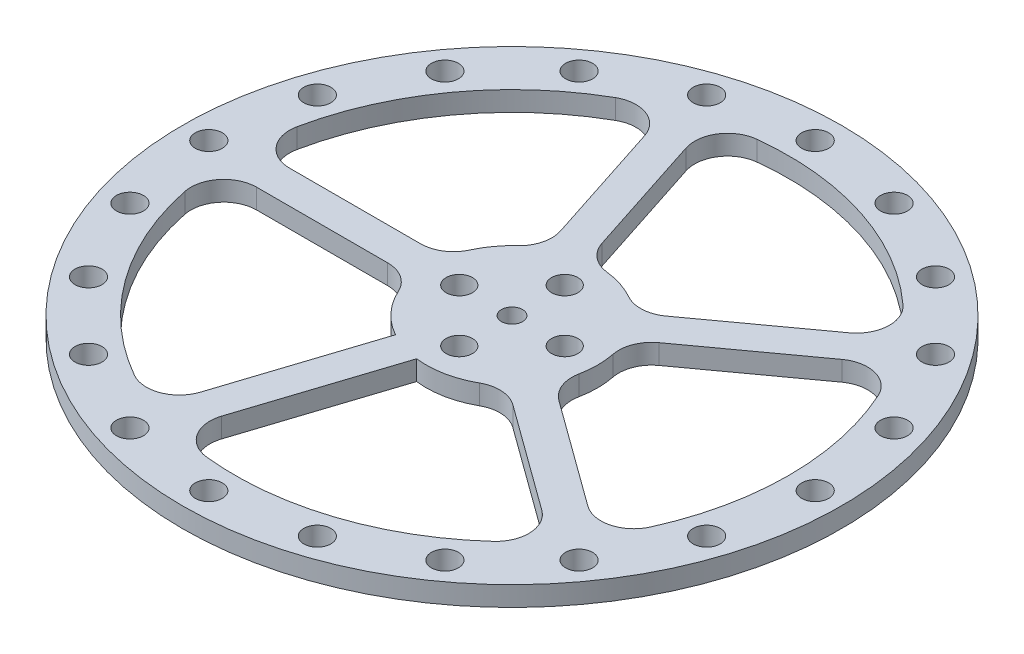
ISO-10303-21;
HEADER;
FILE_DESCRIPTION(('STEP AP214'),'2;1');
FILE_NAME('part.step','',(''),(''),'','','');
FILE_SCHEMA(('AUTOMOTIVE_DESIGN { 1 0 10303 214 1 1 1 1 }'));
ENDSEC;
DATA;
#1=APPLICATION_CONTEXT('core data for automotive mechanical design processes');
#2=APPLICATION_PROTOCOL_DEFINITION('international standard','automotive_design',2000,#1);
#3=PRODUCT_CONTEXT('',#1,'mechanical');
#4=PRODUCT('Part','Part','',(#3));
#5=PRODUCT_RELATED_PRODUCT_CATEGORY('part','',(#4));
#6=PRODUCT_DEFINITION_FORMATION('','',#4);
#7=PRODUCT_DEFINITION_CONTEXT('part definition',#1,'design');
#8=PRODUCT_DEFINITION('design','',#6,#7);
#9=PRODUCT_DEFINITION_SHAPE('','',#8);
#10=(LENGTH_UNIT() NAMED_UNIT(*) SI_UNIT(.MILLI.,.METRE.));
#11=(NAMED_UNIT(*) PLANE_ANGLE_UNIT() SI_UNIT($,.RADIAN.));
#12=(NAMED_UNIT(*) SI_UNIT($,.STERADIAN.) SOLID_ANGLE_UNIT());
#13=UNCERTAINTY_MEASURE_WITH_UNIT(LENGTH_MEASURE(1.E-05),#10,'distance_accuracy_value','');
#14=(GEOMETRIC_REPRESENTATION_CONTEXT(3) GLOBAL_UNCERTAINTY_ASSIGNED_CONTEXT((#13)) GLOBAL_UNIT_ASSIGNED_CONTEXT((#10,
#11,#12)) REPRESENTATION_CONTEXT('',''));
#15=CARTESIAN_POINT('',(0.,0.,0.));
#16=DIRECTION('',(0.,0.,1.));
#17=DIRECTION('',(1.,0.,0.));
#18=AXIS2_PLACEMENT_3D('',#15,#16,#17);
#19=CARTESIAN_POINT('',(0.,3.,0.));
#20=DIRECTION('',(0.,1.,0.));
#21=DIRECTION('',(0.,0.,1.));
#22=AXIS2_PLACEMENT_3D('',#19,#20,#21);
#23=PLANE('',#22);
#24=CARTESIAN_POINT('',(-8.,3.,0.));
#25=DIRECTION('',(0.,1.,0.));
#26=DIRECTION('',(1.,0.,0.));
#27=AXIS2_PLACEMENT_3D('',#24,#25,#26);
#28=CIRCLE('',#27,2.);
#29=CARTESIAN_POINT('',(-6.,3.,0.));
#30=VERTEX_POINT('',#29);
#31=EDGE_CURVE('E1367',#30,#30,#28,.T.);
#32=ORIENTED_EDGE('',*,*,#31,.F.);
#33=EDGE_LOOP('',(#32));
#34=FACE_BOUND('',#33,.T.);
#35=CARTESIAN_POINT('',(0.,3.,8.));
#36=DIRECTION('',(0.,1.,0.));
#37=DIRECTION('',(0.,0.,-1.));
#38=AXIS2_PLACEMENT_3D('',#35,#36,#37);
#39=CIRCLE('',#38,2.);
#40=CARTESIAN_POINT('',(0.,3.,6.));
#41=VERTEX_POINT('',#40);
#42=EDGE_CURVE('E1373',#41,#41,#39,.T.);
#43=ORIENTED_EDGE('',*,*,#42,.F.);
#44=EDGE_LOOP('',(#43));
#45=FACE_BOUND('',#44,.T.);
#46=CARTESIAN_POINT('',(8.,3.,0.));
#47=DIRECTION('',(0.,1.,0.));
#48=DIRECTION('',(-1.,0.,0.));
#49=AXIS2_PLACEMENT_3D('',#46,#47,#48);
#50=CIRCLE('',#49,2.);
#51=CARTESIAN_POINT('',(6.,3.,0.));
#52=VERTEX_POINT('',#51);
#53=EDGE_CURVE('E1381',#52,#52,#50,.T.);
#54=ORIENTED_EDGE('',*,*,#53,.F.);
#55=EDGE_LOOP('',(#54));
#56=FACE_BOUND('',#55,.T.);
#57=CARTESIAN_POINT('',(0.,3.,-8.));
#58=DIRECTION('',(0.,1.,0.));
#59=DIRECTION('',(0.,0.,1.));
#60=AXIS2_PLACEMENT_3D('',#57,#58,#59);
#61=CIRCLE('',#60,2.);
#62=CARTESIAN_POINT('',(0.,3.,-6.));
#63=VERTEX_POINT('',#62);
#64=EDGE_CURVE('E1370',#63,#63,#61,.T.);
#65=ORIENTED_EDGE('',*,*,#64,.F.);
#66=EDGE_LOOP('',(#65));
#67=FACE_BOUND('',#66,.T.);
#68=CARTESIAN_POINT('',(-27.0381216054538,3.,-37.2147817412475));
#69=DIRECTION('',(0.,1.,0.));
#70=DIRECTION('',(0.587785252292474,0.,0.809016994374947));
#71=AXIS2_PLACEMENT_3D('',#68,#69,#70);
#72=CIRCLE('',#71,2.05);
#73=CARTESIAN_POINT('',(-25.8331618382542,3.,-35.5562969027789));
#74=VERTEX_POINT('',#73);
#75=EDGE_CURVE('E1406',#74,#74,#72,.T.);
#76=ORIENTED_EDGE('',*,*,#75,.F.);
#77=EDGE_LOOP('',(#76));
#78=FACE_BOUND('',#77,.T.);
#79=CARTESIAN_POINT('',(-37.2147817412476,3.,-27.0381216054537));
#80=DIRECTION('',(0.,1.,0.));
#81=DIRECTION('',(0.809016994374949,0.,0.587785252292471));
#82=AXIS2_PLACEMENT_3D('',#79,#80,#81);
#83=CIRCLE('',#82,2.05);
#84=CARTESIAN_POINT('',(-35.556296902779,3.,-25.8331618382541));
#85=VERTEX_POINT('',#84);
#86=EDGE_CURVE('E1412',#85,#85,#83,.T.);
#87=ORIENTED_EDGE('',*,*,#86,.F.);
#88=EDGE_LOOP('',(#87));
#89=FACE_BOUND('',#88,.T.);
#90=CARTESIAN_POINT('',(-43.7485997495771,3.,-14.2147817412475));
#91=DIRECTION('',(0.,1.,0.));
#92=DIRECTION('',(0.951056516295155,0.,0.309016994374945));
#93=AXIS2_PLACEMENT_3D('',#90,#91,#92);
#94=CIRCLE('',#93,2.05);
#95=CARTESIAN_POINT('',(-41.798933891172,3.,-13.5812969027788));
#96=VERTEX_POINT('',#95);
#97=EDGE_CURVE('E1418',#96,#96,#94,.T.);
#98=ORIENTED_EDGE('',*,*,#97,.F.);
#99=EDGE_LOOP('',(#98));
#100=FACE_BOUND('',#99,.T.);
#101=CARTESIAN_POINT('',(-46.,3.,1.60608141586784E-13));
#102=DIRECTION('',(0.,1.,0.));
#103=DIRECTION('',(1.,0.,0.));
#104=AXIS2_PLACEMENT_3D('',#101,#102,#103);
#105=CIRCLE('',#104,2.05);
#106=CARTESIAN_POINT('',(-43.95,3.,1.53450604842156E-13));
#107=VERTEX_POINT('',#106);
#108=EDGE_CURVE('E1424',#107,#107,#105,.T.);
#109=ORIENTED_EDGE('',*,*,#108,.F.);
#110=EDGE_LOOP('',(#109));
#111=FACE_BOUND('',#110,.T.);
#112=CARTESIAN_POINT('',(-43.748599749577,3.,14.2147817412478));
#113=DIRECTION('',(0.,1.,0.));
#114=DIRECTION('',(0.951056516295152,0.,-0.309016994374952));
#115=AXIS2_PLACEMENT_3D('',#112,#113,#114);
#116=CIRCLE('',#115,2.05);
#117=CARTESIAN_POINT('',(-41.7989338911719,3.,13.5812969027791));
#118=VERTEX_POINT('',#117);
#119=EDGE_CURVE('E1430',#118,#118,#116,.T.);
#120=ORIENTED_EDGE('',*,*,#119,.F.);
#121=EDGE_LOOP('',(#120));
#122=FACE_BOUND('',#121,.T.);
#123=CARTESIAN_POINT('',(-37.2147817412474,3.,27.0381216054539));
#124=DIRECTION('',(0.,1.,0.));
#125=DIRECTION('',(0.809016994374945,0.,-0.587785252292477));
#126=AXIS2_PLACEMENT_3D('',#123,#124,#125);
#127=CIRCLE('',#126,2.05);
#128=CARTESIAN_POINT('',(-35.5562969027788,3.,25.8331618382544));
#129=VERTEX_POINT('',#128);
#130=EDGE_CURVE('E1436',#129,#129,#127,.T.);
#131=ORIENTED_EDGE('',*,*,#130,.F.);
#132=EDGE_LOOP('',(#131));
#133=FACE_BOUND('',#132,.T.);
#134=CARTESIAN_POINT('',(-27.0381216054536,3.,37.2147817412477));
#135=DIRECTION('',(0.,1.,0.));
#136=DIRECTION('',(0.587785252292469,0.,-0.809016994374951));
#137=AXIS2_PLACEMENT_3D('',#134,#135,#136);
#138=CIRCLE('',#137,2.05);
#139=CARTESIAN_POINT('',(-25.833161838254,3.,35.5562969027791));
#140=VERTEX_POINT('',#139);
#141=EDGE_CURVE('E1442',#140,#140,#138,.T.);
#142=ORIENTED_EDGE('',*,*,#141,.F.);
#143=EDGE_LOOP('',(#142));
#144=FACE_BOUND('',#143,.T.);
#145=CARTESIAN_POINT('',(-14.2147817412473,3.,43.7485997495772));
#146=DIRECTION('',(0.,1.,0.));
#147=DIRECTION('',(0.309016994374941,0.,-0.951056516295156));
#148=AXIS2_PLACEMENT_3D('',#145,#146,#147);
#149=CIRCLE('',#148,2.05);
#150=CARTESIAN_POINT('',(-13.5812969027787,3.,41.7989338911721));
#151=VERTEX_POINT('',#150);
#152=EDGE_CURVE('E1448',#151,#151,#149,.T.);
#153=ORIENTED_EDGE('',*,*,#152,.F.);
#154=EDGE_LOOP('',(#153));
#155=FACE_BOUND('',#154,.T.);
#156=CARTESIAN_POINT('',(0.,3.,46.));
#157=DIRECTION('',(0.,1.,0.));
#158=DIRECTION('',(0.,0.,-1.));
#159=AXIS2_PLACEMENT_3D('',#156,#157,#158);
#160=CIRCLE('',#159,2.05);
#161=CARTESIAN_POINT('',(0.,3.,43.95));
#162=VERTEX_POINT('',#161);
#163=EDGE_CURVE('E1454',#162,#162,#160,.T.);
#164=ORIENTED_EDGE('',*,*,#163,.F.);
#165=EDGE_LOOP('',(#164));
#166=FACE_BOUND('',#165,.T.);
#167=CARTESIAN_POINT('',(14.2147817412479,3.,43.748599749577));
#168=DIRECTION('',(0.,1.,0.));
#169=DIRECTION('',(-0.309016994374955,0.,-0.951056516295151));
#170=AXIS2_PLACEMENT_3D('',#167,#168,#169);
#171=CIRCLE('',#170,2.05);
#172=CARTESIAN_POINT('',(13.5812969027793,3.,41.7989338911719));
#173=VERTEX_POINT('',#172);
#174=EDGE_CURVE('E1460',#173,#173,#171,.T.);
#175=ORIENTED_EDGE('',*,*,#174,.F.);
#176=EDGE_LOOP('',(#175));
#177=FACE_BOUND('',#176,.T.);
#178=CARTESIAN_POINT('',(27.0381216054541,3.,37.2147817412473));
#179=DIRECTION('',(0.,1.,0.));
#180=DIRECTION('',(-0.58778525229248,0.,-0.809016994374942));
#181=AXIS2_PLACEMENT_3D('',#178,#179,#180);
#182=CIRCLE('',#181,2.05);
#183=CARTESIAN_POINT('',(25.8331618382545,3.,35.5562969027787));
#184=VERTEX_POINT('',#183);
#185=EDGE_CURVE('E1466',#184,#184,#182,.T.);
#186=ORIENTED_EDGE('',*,*,#185,.F.);
#187=EDGE_LOOP('',(#186));
#188=FACE_BOUND('',#187,.T.);
#189=CARTESIAN_POINT('',(37.2147817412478,3.,27.0381216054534));
#190=DIRECTION('',(0.,1.,0.));
#191=DIRECTION('',(-0.809016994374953,0.,-0.587785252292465));
#192=AXIS2_PLACEMENT_3D('',#189,#190,#191);
#193=CIRCLE('',#192,2.05);
#194=CARTESIAN_POINT('',(35.5562969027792,3.,25.8331618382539));
#195=VERTEX_POINT('',#194);
#196=EDGE_CURVE('E1472',#195,#195,#193,.T.);
#197=ORIENTED_EDGE('',*,*,#196,.F.);
#198=EDGE_LOOP('',(#197));
#199=FACE_BOUND('',#198,.T.);
#200=CARTESIAN_POINT('',(43.7485997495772,3.,14.2147817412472));
#201=DIRECTION('',(0.,1.,0.));
#202=DIRECTION('',(-0.951056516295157,0.,-0.309016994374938));
#203=AXIS2_PLACEMENT_3D('',#200,#201,#202);
#204=CIRCLE('',#203,2.05);
#205=CARTESIAN_POINT('',(41.7989338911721,3.,13.5812969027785));
#206=VERTEX_POINT('',#205);
#207=EDGE_CURVE('E1478',#206,#206,#204,.T.);
#208=ORIENTED_EDGE('',*,*,#207,.F.);
#209=EDGE_LOOP('',(#208));
#210=FACE_BOUND('',#209,.T.);
#211=CARTESIAN_POINT('',(46.,3.,-4.81824424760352E-13));
#212=DIRECTION('',(0.,1.,0.));
#213=DIRECTION('',(-1.,0.,0.));
#214=AXIS2_PLACEMENT_3D('',#211,#212,#213);
#215=CIRCLE('',#214,2.05);
#216=CARTESIAN_POINT('',(43.95,3.,-4.60351814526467E-13));
#217=VERTEX_POINT('',#216);
#218=EDGE_CURVE('E1484',#217,#217,#215,.T.);
#219=ORIENTED_EDGE('',*,*,#218,.F.);
#220=EDGE_LOOP('',(#219));
#221=FACE_BOUND('',#220,.T.);
#222=CARTESIAN_POINT('',(43.7485997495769,3.,-14.2147817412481));
#223=DIRECTION('',(0.,1.,0.));
#224=DIRECTION('',(-0.95105651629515,0.,0.309016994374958));
#225=AXIS2_PLACEMENT_3D('',#222,#223,#224);
#226=CIRCLE('',#225,2.05);
#227=CARTESIAN_POINT('',(41.7989338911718,3.,-13.5812969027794));
#228=VERTEX_POINT('',#227);
#229=EDGE_CURVE('E1490',#228,#228,#226,.T.);
#230=ORIENTED_EDGE('',*,*,#229,.F.);
#231=EDGE_LOOP('',(#230));
#232=FACE_BOUND('',#231,.T.);
#233=CARTESIAN_POINT('',(37.2147817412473,3.,-27.0381216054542));
#234=DIRECTION('',(0.,1.,0.));
#235=DIRECTION('',(-0.80901699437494,0.,0.587785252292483));
#236=AXIS2_PLACEMENT_3D('',#233,#234,#235);
#237=CIRCLE('',#236,2.05);
#238=CARTESIAN_POINT('',(35.5562969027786,3.,-25.8331618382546));
#239=VERTEX_POINT('',#238);
#240=EDGE_CURVE('E1393',#239,#239,#237,.T.);
#241=ORIENTED_EDGE('',*,*,#240,.F.);
#242=EDGE_LOOP('',(#241));
#243=FACE_BOUND('',#242,.T.);
#244=CARTESIAN_POINT('',(27.0381216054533,3.,-37.2147817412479));
#245=DIRECTION('',(0.,1.,0.));
#246=DIRECTION('',(-0.587785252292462,0.,0.809016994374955));
#247=AXIS2_PLACEMENT_3D('',#244,#245,#246);
#248=CIRCLE('',#247,2.05);
#249=CARTESIAN_POINT('',(25.8331618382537,3.,-35.5562969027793));
#250=VERTEX_POINT('',#249);
#251=EDGE_CURVE('E1394',#250,#250,#248,.T.);
#252=ORIENTED_EDGE('',*,*,#251,.F.);
#253=EDGE_LOOP('',(#252));
#254=FACE_BOUND('',#253,.T.);
#255=CARTESIAN_POINT('',(14.214781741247,3.,-43.7485997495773));
#256=DIRECTION('',(0.,1.,0.));
#257=DIRECTION('',(-0.309016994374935,0.,0.951056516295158));
#258=AXIS2_PLACEMENT_3D('',#255,#256,#257);
#259=CIRCLE('',#258,2.05);
#260=CARTESIAN_POINT('',(13.5812969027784,3.,-41.7989338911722));
#261=VERTEX_POINT('',#260);
#262=EDGE_CURVE('E1387',#261,#261,#259,.T.);
#263=ORIENTED_EDGE('',*,*,#262,.F.);
#264=EDGE_LOOP('',(#263));
#265=FACE_BOUND('',#264,.T.);
#266=CARTESIAN_POINT('',(-14.2147817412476,3.,-43.7485997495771));
#267=DIRECTION('',(0.,1.,0.));
#268=DIRECTION('',(0.309016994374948,0.,0.951056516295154));
#269=AXIS2_PLACEMENT_3D('',#266,#267,#268);
#270=CIRCLE('',#269,2.05);
#271=CARTESIAN_POINT('',(-13.581296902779,3.,-41.798933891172));
#272=VERTEX_POINT('',#271);
#273=EDGE_CURVE('E1405',#272,#272,#270,.T.);
#274=ORIENTED_EDGE('',*,*,#273,.F.);
#275=EDGE_LOOP('',(#274));
#276=FACE_BOUND('',#275,.T.);
#277=CARTESIAN_POINT('',(0.,3.,-46.));
#278=DIRECTION('',(0.,1.,0.));
#279=DIRECTION('',(0.,0.,1.));
#280=AXIS2_PLACEMENT_3D('',#277,#278,#279);
#281=CIRCLE('',#280,2.05);
#282=CARTESIAN_POINT('',(0.,3.,-43.95));
#283=VERTEX_POINT('',#282);
#284=EDGE_CURVE('E507',#283,#283,#281,.T.);
#285=ORIENTED_EDGE('',*,*,#284,.F.);
#286=EDGE_LOOP('',(#285));
#287=FACE_BOUND('',#286,.T.);
#288=CARTESIAN_POINT('',(0.,3.,0.));
#289=DIRECTION('',(0.,1.,0.));
#290=DIRECTION('',(0.,0.,1.));
#291=AXIS2_PLACEMENT_3D('',#288,#289,#290);
#292=CIRCLE('',#291,1.6);
#293=CARTESIAN_POINT('',(0.,3.,1.6));
#294=VERTEX_POINT('',#293);
#295=EDGE_CURVE('E566',#294,#294,#292,.T.);
#296=ORIENTED_EDGE('',*,*,#295,.F.);
#297=EDGE_LOOP('',(#296));
#298=FACE_BOUND('',#297,.T.);
#299=CARTESIAN_POINT('',(0.,3.,0.));
#300=DIRECTION('',(0.,1.,0.));
#301=DIRECTION('',(0.,0.,1.));
#302=AXIS2_PLACEMENT_3D('',#299,#300,#301);
#303=CIRCLE('',#302,50.);
#304=CARTESIAN_POINT('',(0.,3.,50.));
#305=VERTEX_POINT('',#304);
#306=EDGE_CURVE('E571',#305,#305,#303,.T.);
#307=ORIENTED_EDGE('',*,*,#306,.T.);
#308=EDGE_LOOP('',(#307));
#309=FACE_BOUND('',#308,.T.);
#310=CARTESIAN_POINT('',(0.,3.,0.));
#311=DIRECTION('',(0.,1.,0.));
#312=DIRECTION('',(0.,0.,1.));
#313=AXIS2_PLACEMENT_3D('',#310,#311,#312);
#314=CIRCLE('',#313,42.);
#315=CARTESIAN_POINT('',(-41.1280936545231,3.,8.51351351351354));
#316=VERTEX_POINT('',#315);
#317=CARTESIAN_POINT('',(-20.8061123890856,3.,36.4843211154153));
#318=VERTEX_POINT('',#317);
#319=EDGE_CURVE('E579',#316,#318,#314,.T.);
#320=ORIENTED_EDGE('',*,*,#319,.F.);
#321=CARTESIAN_POINT('',(-36.2318920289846,3.,7.50000000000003));
#322=DIRECTION('',(0.,1.,0.));
#323=DIRECTION('',(0.,0.,1.));
#324=AXIS2_PLACEMENT_3D('',#321,#322,#323);
#325=CIRCLE('',#324,5.);
#326=CARTESIAN_POINT('',(-36.2318920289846,3.,2.50000000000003));
#327=VERTEX_POINT('',#326);
#328=EDGE_CURVE('E687',#316,#327,#325,.F.);
#329=ORIENTED_EDGE('',*,*,#328,.T.);
#330=DIRECTION('',(1.,0.,0.));
#331=VECTOR('',#330,1.);
#332=CARTESIAN_POINT('',(0.,3.,2.50000000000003));
#333=LINE('',#332,#331);
#334=CARTESIAN_POINT('',(-16.3630681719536,3.,2.50000000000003));
#335=VERTEX_POINT('',#334);
#336=EDGE_CURVE('E562',#327,#335,#333,.T.);
#337=ORIENTED_EDGE('',*,*,#336,.T.);
#338=CARTESIAN_POINT('',(-16.3630681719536,3.,7.5));
#339=DIRECTION('',(0.,1.,0.));
#340=DIRECTION('',(0.,0.,1.));
#341=AXIS2_PLACEMENT_3D('',#338,#339,#340);
#342=CIRCLE('',#341,5.);
#343=CARTESIAN_POINT('',(-11.817771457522,3.,5.41666666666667));
#344=VERTEX_POINT('',#343);
#345=EDGE_CURVE('E760',#335,#344,#342,.F.);
#346=ORIENTED_EDGE('',*,*,#345,.T.);
#347=CARTESIAN_POINT('',(0.,3.,0.));
#348=DIRECTION('',(0.,1.,0.));
#349=DIRECTION('',(0.,0.,1.));
#350=AXIS2_PLACEMENT_3D('',#347,#348,#349);
#351=CIRCLE('',#350,13.);
#352=CARTESIAN_POINT('',(-6.31987949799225,3.,11.3604191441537));
#353=VERTEX_POINT('',#352);
#354=EDGE_CURVE('E585',#344,#353,#351,.T.);
#355=ORIENTED_EDGE('',*,*,#354,.T.);
#356=DIRECTION('',(0.309016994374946,0.,-0.951056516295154));
#357=VECTOR('',#356,1.);
#358=CARTESIAN_POINT('',(-2.37764129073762,3.,-0.772542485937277));
#359=LINE('',#358,#357);
#360=CARTESIAN_POINT('',(-13.573911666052,3.,33.6860345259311));
#361=VERTEX_POINT('',#360);
#362=EDGE_CURVE('E582',#361,#353,#359,.T.);
#363=ORIENTED_EDGE('',*,*,#362,.F.);
#364=CARTESIAN_POINT('',(-18.3291942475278,3.,32.1409495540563));
#365=DIRECTION('',(0.,1.,0.));
#366=DIRECTION('',(0.,0.,1.));
#367=AXIS2_PLACEMENT_3D('',#364,#365,#366);
#368=CIRCLE('',#367,5.);
#369=EDGE_CURVE('E683',#361,#318,#368,.F.);
#370=ORIENTED_EDGE('',*,*,#369,.T.);
#371=EDGE_LOOP('',(#320,#329,#337,#346,#355,#363,#370));
#372=FACE_BOUND('',#371,.T.);
#373=CARTESIAN_POINT('',(0.,3.,0.));
#374=DIRECTION('',(0.,1.,0.));
#375=DIRECTION('',(0.,0.,1.));
#376=AXIS2_PLACEMENT_3D('',#373,#374,#375);
#377=CIRCLE('',#376,42.);
#378=CARTESIAN_POINT('',(38.2774444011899,3.,17.2869097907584));
#379=VERTEX_POINT('',#378);
#380=CARTESIAN_POINT('',(38.2774444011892,3.,-17.2869097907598));
#381=VERTEX_POINT('',#380);
#382=EDGE_CURVE('E590',#379,#381,#377,.T.);
#383=ORIENTED_EDGE('',*,*,#382,.F.);
#384=CARTESIAN_POINT('',(33.7206057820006,3.,15.2289443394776));
#385=DIRECTION('',(0.,1.,0.));
#386=DIRECTION('',(0.,0.,1.));
#387=AXIS2_PLACEMENT_3D('',#384,#385,#386);
#388=CIRCLE('',#387,5.);
#389=CARTESIAN_POINT('',(30.7816795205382,3.,19.2740293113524));
#390=VERTEX_POINT('',#389);
#391=EDGE_CURVE('E695',#379,#390,#388,.F.);
#392=ORIENTED_EDGE('',*,*,#391,.T.);
#393=DIRECTION('',(-0.809016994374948,0.,-0.587785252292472));
#394=VECTOR('',#393,1.);
#395=CARTESIAN_POINT('',(35.3879287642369,3.,22.620665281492));
#396=LINE('',#395,#394);
#397=CARTESIAN_POINT('',(14.7074633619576,3.,7.59542766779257));
#398=VERTEX_POINT('',#397);
#399=EDGE_CURVE('E587',#390,#398,#396,.T.);
#400=ORIENTED_EDGE('',*,*,#399,.T.);
#401=CARTESIAN_POINT('',(17.6463896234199,3.,3.55034269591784));
#402=DIRECTION('',(0.,1.,0.));
#403=DIRECTION('',(0.,0.,1.));
#404=AXIS2_PLACEMENT_3D('',#401,#402,#403);
#405=CIRCLE('',#404,5.);
#406=CARTESIAN_POINT('',(12.7446147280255,3.,2.56413639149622));
#407=VERTEX_POINT('',#406);
#408=EDGE_CURVE('E764',#398,#407,#405,.F.);
#409=ORIENTED_EDGE('',*,*,#408,.T.);
#410=CARTESIAN_POINT('',(0.,3.,0.));
#411=DIRECTION('',(0.,1.,0.));
#412=DIRECTION('',(0.,0.,1.));
#413=AXIS2_PLACEMENT_3D('',#410,#411,#412);
#414=CIRCLE('',#413,13.);
#415=CARTESIAN_POINT('',(12.7446147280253,3.,-2.5641363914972));
#416=VERTEX_POINT('',#415);
#417=EDGE_CURVE('E596',#407,#416,#414,.T.);
#418=ORIENTED_EDGE('',*,*,#417,.T.);
#419=CARTESIAN_POINT('',(17.6463896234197,3.,-3.5503426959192));
#420=DIRECTION('',(0.,1.,0.));
#421=DIRECTION('',(0.,0.,1.));
#422=AXIS2_PLACEMENT_3D('',#419,#420,#421);
#423=CIRCLE('',#422,5.);
#424=CARTESIAN_POINT('',(14.7074633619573,3.,-7.59542766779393));
#425=VERTEX_POINT('',#424);
#426=EDGE_CURVE('E768',#416,#425,#423,.F.);
#427=ORIENTED_EDGE('',*,*,#426,.T.);
#428=DIRECTION('',(-0.809016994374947,0.,0.587785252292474));
#429=VECTOR('',#428,1.);
#430=CARTESIAN_POINT('',(1.46946313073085,3.,2.02254248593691));
#431=LINE('',#430,#429);
#432=CARTESIAN_POINT('',(30.7816795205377,3.,-19.2740293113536));
#433=VERTEX_POINT('',#432);
#434=EDGE_CURVE('E593',#433,#425,#431,.T.);
#435=ORIENTED_EDGE('',*,*,#434,.F.);
#436=CARTESIAN_POINT('',(33.720605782,3.,-15.2289443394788));
#437=DIRECTION('',(0.,1.,0.));
#438=DIRECTION('',(0.,0.,1.));
#439=AXIS2_PLACEMENT_3D('',#436,#437,#438);
#440=CIRCLE('',#439,5.);
#441=EDGE_CURVE('E699',#433,#381,#440,.F.);
#442=ORIENTED_EDGE('',*,*,#441,.T.);
#443=EDGE_LOOP('',(#383,#392,#400,#409,#418,#427,#435,#442));
#444=FACE_BOUND('',#443,.T.);
#445=CARTESIAN_POINT('',(0.,3.,0.));
#446=DIRECTION('',(0.,1.,0.));
#447=DIRECTION('',(0.,0.,1.));
#448=AXIS2_PLACEMENT_3D('',#445,#446,#447);
#449=CIRCLE('',#448,42.);
#450=CARTESIAN_POINT('',(-4.61244738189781,3.,41.745961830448));
#451=VERTEX_POINT('',#450);
#452=CARTESIAN_POINT('',(28.2692090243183,3.,31.062064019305));
#453=VERTEX_POINT('',#452);
#454=EDGE_CURVE('E601',#451,#453,#449,.T.);
#455=ORIENTED_EDGE('',*,*,#454,.F.);
#456=CARTESIAN_POINT('',(-4.06334650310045,3.,36.7762044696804));
#457=DIRECTION('',(0.,1.,0.));
#458=DIRECTION('',(0.,0.,1.));
#459=AXIS2_PLACEMENT_3D('',#456,#457,#458);
#460=CIRCLE('',#459,5.);
#461=CARTESIAN_POINT('',(-8.81862908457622,3.,35.2311194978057));
#462=VERTEX_POINT('',#461);
#463=EDGE_CURVE('E679',#451,#462,#460,.F.);
#464=ORIENTED_EDGE('',*,*,#463,.T.);
#465=DIRECTION('',(0.309016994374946,0.,-0.951056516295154));
#466=VECTOR('',#465,1.);
#467=CARTESIAN_POINT('',(-10.5780597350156,3.,40.6460902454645));
#468=LINE('',#467,#466);
#469=CARTESIAN_POINT('',(-1.56459691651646,3.,12.9055041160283));
#470=VERTEX_POINT('',#469);
#471=EDGE_CURVE('E599',#462,#470,#468,.T.);
#472=ORIENTED_EDGE('',*,*,#471,.T.);
#473=CARTESIAN_POINT('',(0.,3.,0.));
#474=DIRECTION('',(0.,1.,0.));
#475=DIRECTION('',(0.,0.,1.));
#476=AXIS2_PLACEMENT_3D('',#473,#474,#475);
#477=CIRCLE('',#476,13.);
#478=CARTESIAN_POINT('',(6.37694116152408,3.,11.3284871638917));
#479=VERTEX_POINT('',#478);
#480=EDGE_CURVE('E495',#470,#479,#477,.T.);
#481=ORIENTED_EDGE('',*,*,#480,.T.);
#482=CARTESIAN_POINT('',(8.82961083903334,3.,15.6855976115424));
#483=DIRECTION('',(0.,1.,0.));
#484=DIRECTION('',(0.,0.,1.));
#485=AXIS2_PLACEMENT_3D('',#482,#483,#484);
#486=CIRCLE('',#485,5.);
#487=CARTESIAN_POINT('',(11.7685371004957,3.,11.6405126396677));
#488=VERTEX_POINT('',#487);
#489=EDGE_CURVE('E757',#479,#488,#486,.F.);
#490=ORIENTED_EDGE('',*,*,#489,.T.);
#491=DIRECTION('',(-0.809016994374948,0.,-0.587785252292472));
#492=VECTOR('',#491,1.);
#493=CARTESIAN_POINT('',(-1.4694631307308,3.,2.02254248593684));
#494=LINE('',#493,#492);
#495=CARTESIAN_POINT('',(27.8427532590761,3.,23.3191142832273));
#496=VERTEX_POINT('',#495);
#497=EDGE_CURVE('E604',#496,#488,#494,.T.);
#498=ORIENTED_EDGE('',*,*,#497,.F.);
#499=CARTESIAN_POINT('',(24.9038269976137,3.,27.364199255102));
#500=DIRECTION('',(0.,1.,0.));
#501=DIRECTION('',(0.,0.,1.));
#502=AXIS2_PLACEMENT_3D('',#499,#500,#501);
#503=CIRCLE('',#502,5.);
#504=EDGE_CURVE('E691',#496,#453,#503,.F.);
#505=ORIENTED_EDGE('',*,*,#504,.T.);
#506=EDGE_LOOP('',(#455,#464,#472,#481,#490,#498,#505));
#507=FACE_BOUND('',#506,.T.);
#508=CARTESIAN_POINT('',(0.,3.,0.));
#509=DIRECTION('',(0.,1.,0.));
#510=DIRECTION('',(0.,0.,1.));
#511=AXIS2_PLACEMENT_3D('',#508,#509,#510);
#512=CIRCLE('',#511,42.);
#513=CARTESIAN_POINT('',(-20.8061123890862,3.,-36.484321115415));
#514=VERTEX_POINT('',#513);
#515=CARTESIAN_POINT('',(-41.1280936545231,3.,-8.51351351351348));
#516=VERTEX_POINT('',#515);
#517=EDGE_CURVE('E611',#514,#516,#512,.T.);
#518=ORIENTED_EDGE('',*,*,#517,.F.);
#519=CARTESIAN_POINT('',(-18.3291942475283,3.,-32.1409495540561));
#520=DIRECTION('',(0.,1.,0.));
#521=DIRECTION('',(0.,0.,1.));
#522=AXIS2_PLACEMENT_3D('',#519,#520,#521);
#523=CIRCLE('',#522,5.);
#524=CARTESIAN_POINT('',(-13.5739116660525,3.,-33.6860345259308));
#525=VERTEX_POINT('',#524);
#526=EDGE_CURVE('E711',#514,#525,#523,.F.);
#527=ORIENTED_EDGE('',*,*,#526,.T.);
#528=DIRECTION('',(0.309016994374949,0.,0.951056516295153));
#529=VECTOR('',#528,1.);
#530=CARTESIAN_POINT('',(-15.333342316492,3.,-39.1010052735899));
#531=LINE('',#530,#529);
#532=CARTESIAN_POINT('',(-7.43410743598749,3.,-14.7896601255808));
#533=VERTEX_POINT('',#532);
#534=EDGE_CURVE('E608',#525,#533,#531,.T.);
#535=ORIENTED_EDGE('',*,*,#534,.T.);
#536=CARTESIAN_POINT('',(-12.1893900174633,3.,-13.244575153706));
#537=DIRECTION('',(0.,1.,0.));
#538=DIRECTION('',(0.,0.,1.));
#539=AXIS2_PLACEMENT_3D('',#536,#537,#538);
#540=CIRCLE('',#539,5.);
#541=CARTESIAN_POINT('',(-8.80344834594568,3.,-9.5655264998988));
#542=VERTEX_POINT('',#541);
#543=EDGE_CURVE('E238',#533,#542,#540,.F.);
#544=ORIENTED_EDGE('',*,*,#543,.T.);
#545=CARTESIAN_POINT('',(0.,3.,0.));
#546=DIRECTION('',(0.,1.,0.));
#547=DIRECTION('',(0.,0.,1.));
#548=AXIS2_PLACEMENT_3D('',#545,#546,#547);
#549=CIRCLE('',#548,13.);
#550=CARTESIAN_POINT('',(-11.817771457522,3.,-5.41666666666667));
#551=VERTEX_POINT('',#550);
#552=EDGE_CURVE('E617',#542,#551,#549,.T.);
#553=ORIENTED_EDGE('',*,*,#552,.T.);
#554=CARTESIAN_POINT('',(-16.3630681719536,3.,-7.5));
#555=DIRECTION('',(0.,1.,0.));
#556=DIRECTION('',(0.,0.,1.));
#557=AXIS2_PLACEMENT_3D('',#554,#555,#556);
#558=CIRCLE('',#557,5.);
#559=CARTESIAN_POINT('',(-16.3630681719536,3.,-2.5));
#560=VERTEX_POINT('',#559);
#561=EDGE_CURVE('E780',#551,#560,#558,.F.);
#562=ORIENTED_EDGE('',*,*,#561,.T.);
#563=DIRECTION('',(1.,0.,0.));
#564=VECTOR('',#563,1.);
#565=CARTESIAN_POINT('',(0.,3.,-2.50000000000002));
#566=LINE('',#565,#564);
#567=CARTESIAN_POINT('',(-36.2318920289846,3.,-2.49999999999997));
#568=VERTEX_POINT('',#567);
#569=EDGE_CURVE('E614',#568,#560,#566,.T.);
#570=ORIENTED_EDGE('',*,*,#569,.F.);
#571=CARTESIAN_POINT('',(-36.2318920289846,3.,-7.49999999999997));
#572=DIRECTION('',(0.,1.,0.));
#573=DIRECTION('',(0.,0.,1.));
#574=AXIS2_PLACEMENT_3D('',#571,#572,#573);
#575=CIRCLE('',#574,5.);
#576=EDGE_CURVE('E715',#568,#516,#575,.F.);
#577=ORIENTED_EDGE('',*,*,#576,.T.);
#578=EDGE_LOOP('',(#518,#527,#535,#544,#553,#562,#570,#577));
#579=FACE_BOUND('',#578,.T.);
#580=CARTESIAN_POINT('',(0.,3.,0.));
#581=DIRECTION('',(0.,1.,0.));
#582=DIRECTION('',(0.,0.,1.));
#583=AXIS2_PLACEMENT_3D('',#580,#581,#582);
#584=CIRCLE('',#583,42.);
#585=CARTESIAN_POINT('',(28.2692090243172,3.,-31.062064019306));
#586=VERTEX_POINT('',#585);
#587=CARTESIAN_POINT('',(-4.61244738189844,3.,-41.745961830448));
#588=VERTEX_POINT('',#587);
#589=EDGE_CURVE('E623',#586,#588,#584,.T.);
#590=ORIENTED_EDGE('',*,*,#589,.F.);
#591=CARTESIAN_POINT('',(24.9038269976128,3.,-27.3641992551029));
#592=DIRECTION('',(0.,1.,0.));
#593=DIRECTION('',(0.,0.,1.));
#594=AXIS2_PLACEMENT_3D('',#591,#592,#593);
#595=CIRCLE('',#594,5.);
#596=CARTESIAN_POINT('',(27.8427532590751,3.,-23.3191142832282));
#597=VERTEX_POINT('',#596);
#598=EDGE_CURVE('E703',#586,#597,#595,.F.);
#599=ORIENTED_EDGE('',*,*,#598,.T.);
#600=DIRECTION('',(-0.809016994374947,0.,0.587785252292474));
#601=VECTOR('',#600,1.);
#602=CARTESIAN_POINT('',(32.449002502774,3.,-26.665750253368));
#603=LINE('',#602,#601);
#604=CARTESIAN_POINT('',(11.7685371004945,3.,-11.6405126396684));
#605=VERTEX_POINT('',#604);
#606=EDGE_CURVE('E620',#597,#605,#603,.T.);
#607=ORIENTED_EDGE('',*,*,#606,.T.);
#608=CARTESIAN_POINT('',(8.82961083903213,3.,-15.6855976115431));
#609=DIRECTION('',(0.,1.,0.));
#610=DIRECTION('',(0.,0.,1.));
#611=AXIS2_PLACEMENT_3D('',#608,#609,#610);
#612=CIRCLE('',#611,5.);
#613=CARTESIAN_POINT('',(6.37694116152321,3.,-11.3284871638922));
#614=VERTEX_POINT('',#613);
#615=EDGE_CURVE('E772',#605,#614,#612,.F.);
#616=ORIENTED_EDGE('',*,*,#615,.T.);
#617=CARTESIAN_POINT('',(0.,3.,0.));
#618=DIRECTION('',(0.,1.,0.));
#619=DIRECTION('',(0.,0.,1.));
#620=AXIS2_PLACEMENT_3D('',#617,#618,#619);
#621=CIRCLE('',#620,13.);
#622=CARTESIAN_POINT('',(1.49966391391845,3.,-12.9132106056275));
#623=VERTEX_POINT('',#622);
#624=EDGE_CURVE('E567',#614,#623,#621,.T.);
#625=ORIENTED_EDGE('',*,*,#624,.T.);
#626=CARTESIAN_POINT('',(2.076457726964,3.,-17.8798300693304));
#627=DIRECTION('',(0.,1.,0.));
#628=DIRECTION('',(0.,0.,1.));
#629=AXIS2_PLACEMENT_3D('',#626,#627,#628);
#630=CIRCLE('',#629,5.);
#631=CARTESIAN_POINT('',(-2.67882485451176,3.,-16.3347450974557));
#632=VERTEX_POINT('',#631);
#633=EDGE_CURVE('E776',#623,#632,#630,.F.);
#634=ORIENTED_EDGE('',*,*,#633,.T.);
#635=DIRECTION('',(0.309016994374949,0.,0.951056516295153));
#636=VECTOR('',#635,1.);
#637=CARTESIAN_POINT('',(2.37764129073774,3.,-0.772542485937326));
#638=LINE('',#637,#636);
#639=CARTESIAN_POINT('',(-8.81862908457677,3.,-35.2311194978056));
#640=VERTEX_POINT('',#639);
#641=EDGE_CURVE('E626',#640,#632,#638,.T.);
#642=ORIENTED_EDGE('',*,*,#641,.F.);
#643=CARTESIAN_POINT('',(-4.06334650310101,3.,-36.7762044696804));
#644=DIRECTION('',(0.,1.,0.));
#645=DIRECTION('',(0.,0.,1.));
#646=AXIS2_PLACEMENT_3D('',#643,#644,#645);
#647=CIRCLE('',#646,5.);
#648=EDGE_CURVE('E707',#640,#588,#647,.F.);
#649=ORIENTED_EDGE('',*,*,#648,.T.);
#650=EDGE_LOOP('',(#590,#599,#607,#616,#625,#634,#642,#649));
#651=FACE_BOUND('',#650,.T.);
#652=ADVANCED_FACE('F230',(#34,#45,#56,#67,#78,#89,#100,#111,#122,#133,#144,#155,#166,#177,#188,
#199,#210,#221,#232,#243,#254,#265,#276,#287,#298,#309,#372,#444,#507,#579,#651),#23,.T.);
#653=CARTESIAN_POINT('',(0.,0.,0.));
#654=DIRECTION('',(0.,1.,0.));
#655=DIRECTION('',(0.,0.,1.));
#656=AXIS2_PLACEMENT_3D('',#653,#654,#655);
#657=PLANE('',#656);
#658=CARTESIAN_POINT('',(-8.,0.,0.));
#659=DIRECTION('',(0.,1.,0.));
#660=DIRECTION('',(1.,0.,0.));
#661=AXIS2_PLACEMENT_3D('',#658,#659,#660);
#662=CIRCLE('',#661,2.);
#663=CARTESIAN_POINT('',(-6.,0.,0.));
#664=VERTEX_POINT('',#663);
#665=EDGE_CURVE('E1365',#664,#664,#662,.T.);
#666=ORIENTED_EDGE('',*,*,#665,.T.);
#667=EDGE_LOOP('',(#666));
#668=FACE_BOUND('',#667,.T.);
#669=CARTESIAN_POINT('',(0.,0.,8.));
#670=DIRECTION('',(0.,1.,0.));
#671=DIRECTION('',(0.,0.,-1.));
#672=AXIS2_PLACEMENT_3D('',#669,#670,#671);
#673=CIRCLE('',#672,2.);
#674=CARTESIAN_POINT('',(0.,0.,6.));
#675=VERTEX_POINT('',#674);
#676=EDGE_CURVE('E1368',#675,#675,#673,.T.);
#677=ORIENTED_EDGE('',*,*,#676,.T.);
#678=EDGE_LOOP('',(#677));
#679=FACE_BOUND('',#678,.T.);
#680=CARTESIAN_POINT('',(8.,0.,0.));
#681=DIRECTION('',(0.,1.,0.));
#682=DIRECTION('',(-1.,0.,0.));
#683=AXIS2_PLACEMENT_3D('',#680,#681,#682);
#684=CIRCLE('',#683,2.);
#685=CARTESIAN_POINT('',(6.,0.,0.));
#686=VERTEX_POINT('',#685);
#687=EDGE_CURVE('E1378',#686,#686,#684,.T.);
#688=ORIENTED_EDGE('',*,*,#687,.T.);
#689=EDGE_LOOP('',(#688));
#690=FACE_BOUND('',#689,.T.);
#691=CARTESIAN_POINT('',(0.,0.,-8.));
#692=DIRECTION('',(0.,1.,0.));
#693=DIRECTION('',(0.,0.,1.));
#694=AXIS2_PLACEMENT_3D('',#691,#692,#693);
#695=CIRCLE('',#694,2.);
#696=CARTESIAN_POINT('',(0.,0.,-6.));
#697=VERTEX_POINT('',#696);
#698=EDGE_CURVE('E1384',#697,#697,#695,.T.);
#699=ORIENTED_EDGE('',*,*,#698,.T.);
#700=EDGE_LOOP('',(#699));
#701=FACE_BOUND('',#700,.T.);
#702=CARTESIAN_POINT('',(-27.0381216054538,0.,-37.2147817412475));
#703=DIRECTION('',(0.,1.,0.));
#704=DIRECTION('',(0.587785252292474,0.,0.809016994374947));
#705=AXIS2_PLACEMENT_3D('',#702,#703,#704);
#706=CIRCLE('',#705,2.05);
#707=CARTESIAN_POINT('',(-25.8331618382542,0.,-35.5562969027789));
#708=VERTEX_POINT('',#707);
#709=EDGE_CURVE('E1402',#708,#708,#706,.T.);
#710=ORIENTED_EDGE('',*,*,#709,.T.);
#711=EDGE_LOOP('',(#710));
#712=FACE_BOUND('',#711,.T.);
#713=CARTESIAN_POINT('',(-37.2147817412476,0.,-27.0381216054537));
#714=DIRECTION('',(0.,1.,0.));
#715=DIRECTION('',(0.809016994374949,0.,0.587785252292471));
#716=AXIS2_PLACEMENT_3D('',#713,#714,#715);
#717=CIRCLE('',#716,2.05);
#718=CARTESIAN_POINT('',(-35.556296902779,0.,-25.8331618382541));
#719=VERTEX_POINT('',#718);
#720=EDGE_CURVE('E1409',#719,#719,#717,.T.);
#721=ORIENTED_EDGE('',*,*,#720,.T.);
#722=EDGE_LOOP('',(#721));
#723=FACE_BOUND('',#722,.T.);
#724=CARTESIAN_POINT('',(-43.7485997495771,0.,-14.2147817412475));
#725=DIRECTION('',(0.,1.,0.));
#726=DIRECTION('',(0.951056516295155,0.,0.309016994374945));
#727=AXIS2_PLACEMENT_3D('',#724,#725,#726);
#728=CIRCLE('',#727,2.05);
#729=CARTESIAN_POINT('',(-41.798933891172,0.,-13.5812969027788));
#730=VERTEX_POINT('',#729);
#731=EDGE_CURVE('E1415',#730,#730,#728,.T.);
#732=ORIENTED_EDGE('',*,*,#731,.T.);
#733=EDGE_LOOP('',(#732));
#734=FACE_BOUND('',#733,.T.);
#735=CARTESIAN_POINT('',(-46.,0.,1.60608141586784E-13));
#736=DIRECTION('',(0.,1.,0.));
#737=DIRECTION('',(1.,0.,0.));
#738=AXIS2_PLACEMENT_3D('',#735,#736,#737);
#739=CIRCLE('',#738,2.05);
#740=CARTESIAN_POINT('',(-43.95,0.,1.53450604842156E-13));
#741=VERTEX_POINT('',#740);
#742=EDGE_CURVE('E1421',#741,#741,#739,.T.);
#743=ORIENTED_EDGE('',*,*,#742,.T.);
#744=EDGE_LOOP('',(#743));
#745=FACE_BOUND('',#744,.T.);
#746=CARTESIAN_POINT('',(-43.748599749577,0.,14.2147817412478));
#747=DIRECTION('',(0.,1.,0.));
#748=DIRECTION('',(0.951056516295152,0.,-0.309016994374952));
#749=AXIS2_PLACEMENT_3D('',#746,#747,#748);
#750=CIRCLE('',#749,2.05);
#751=CARTESIAN_POINT('',(-41.7989338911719,0.,13.5812969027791));
#752=VERTEX_POINT('',#751);
#753=EDGE_CURVE('E1427',#752,#752,#750,.T.);
#754=ORIENTED_EDGE('',*,*,#753,.T.);
#755=EDGE_LOOP('',(#754));
#756=FACE_BOUND('',#755,.T.);
#757=CARTESIAN_POINT('',(-37.2147817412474,0.,27.0381216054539));
#758=DIRECTION('',(0.,1.,0.));
#759=DIRECTION('',(0.809016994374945,0.,-0.587785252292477));
#760=AXIS2_PLACEMENT_3D('',#757,#758,#759);
#761=CIRCLE('',#760,2.05);
#762=CARTESIAN_POINT('',(-35.5562969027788,0.,25.8331618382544));
#763=VERTEX_POINT('',#762);
#764=EDGE_CURVE('E1433',#763,#763,#761,.T.);
#765=ORIENTED_EDGE('',*,*,#764,.T.);
#766=EDGE_LOOP('',(#765));
#767=FACE_BOUND('',#766,.T.);
#768=CARTESIAN_POINT('',(-27.0381216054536,0.,37.2147817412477));
#769=DIRECTION('',(0.,1.,0.));
#770=DIRECTION('',(0.587785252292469,0.,-0.809016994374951));
#771=AXIS2_PLACEMENT_3D('',#768,#769,#770);
#772=CIRCLE('',#771,2.05);
#773=CARTESIAN_POINT('',(-25.833161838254,0.,35.5562969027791));
#774=VERTEX_POINT('',#773);
#775=EDGE_CURVE('E1439',#774,#774,#772,.T.);
#776=ORIENTED_EDGE('',*,*,#775,.T.);
#777=EDGE_LOOP('',(#776));
#778=FACE_BOUND('',#777,.T.);
#779=CARTESIAN_POINT('',(-14.2147817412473,0.,43.7485997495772));
#780=DIRECTION('',(0.,1.,0.));
#781=DIRECTION('',(0.309016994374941,0.,-0.951056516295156));
#782=AXIS2_PLACEMENT_3D('',#779,#780,#781);
#783=CIRCLE('',#782,2.05);
#784=CARTESIAN_POINT('',(-13.5812969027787,0.,41.7989338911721));
#785=VERTEX_POINT('',#784);
#786=EDGE_CURVE('E1445',#785,#785,#783,.T.);
#787=ORIENTED_EDGE('',*,*,#786,.T.);
#788=EDGE_LOOP('',(#787));
#789=FACE_BOUND('',#788,.T.);
#790=CARTESIAN_POINT('',(0.,0.,46.));
#791=DIRECTION('',(0.,1.,0.));
#792=DIRECTION('',(0.,0.,-1.));
#793=AXIS2_PLACEMENT_3D('',#790,#791,#792);
#794=CIRCLE('',#793,2.05);
#795=CARTESIAN_POINT('',(0.,0.,43.95));
#796=VERTEX_POINT('',#795);
#797=EDGE_CURVE('E1451',#796,#796,#794,.T.);
#798=ORIENTED_EDGE('',*,*,#797,.T.);
#799=EDGE_LOOP('',(#798));
#800=FACE_BOUND('',#799,.T.);
#801=CARTESIAN_POINT('',(14.2147817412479,0.,43.748599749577));
#802=DIRECTION('',(0.,1.,0.));
#803=DIRECTION('',(-0.309016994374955,0.,-0.951056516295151));
#804=AXIS2_PLACEMENT_3D('',#801,#802,#803);
#805=CIRCLE('',#804,2.05);
#806=CARTESIAN_POINT('',(13.5812969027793,0.,41.7989338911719));
#807=VERTEX_POINT('',#806);
#808=EDGE_CURVE('E1457',#807,#807,#805,.T.);
#809=ORIENTED_EDGE('',*,*,#808,.T.);
#810=EDGE_LOOP('',(#809));
#811=FACE_BOUND('',#810,.T.);
#812=CARTESIAN_POINT('',(27.0381216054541,0.,37.2147817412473));
#813=DIRECTION('',(0.,1.,0.));
#814=DIRECTION('',(-0.58778525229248,0.,-0.809016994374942));
#815=AXIS2_PLACEMENT_3D('',#812,#813,#814);
#816=CIRCLE('',#815,2.05);
#817=CARTESIAN_POINT('',(25.8331618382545,0.,35.5562969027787));
#818=VERTEX_POINT('',#817);
#819=EDGE_CURVE('E1463',#818,#818,#816,.T.);
#820=ORIENTED_EDGE('',*,*,#819,.T.);
#821=EDGE_LOOP('',(#820));
#822=FACE_BOUND('',#821,.T.);
#823=CARTESIAN_POINT('',(37.2147817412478,0.,27.0381216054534));
#824=DIRECTION('',(0.,1.,0.));
#825=DIRECTION('',(-0.809016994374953,0.,-0.587785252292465));
#826=AXIS2_PLACEMENT_3D('',#823,#824,#825);
#827=CIRCLE('',#826,2.05);
#828=CARTESIAN_POINT('',(35.5562969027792,0.,25.8331618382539));
#829=VERTEX_POINT('',#828);
#830=EDGE_CURVE('E1469',#829,#829,#827,.T.);
#831=ORIENTED_EDGE('',*,*,#830,.T.);
#832=EDGE_LOOP('',(#831));
#833=FACE_BOUND('',#832,.T.);
#834=CARTESIAN_POINT('',(43.7485997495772,0.,14.2147817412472));
#835=DIRECTION('',(0.,1.,0.));
#836=DIRECTION('',(-0.951056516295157,0.,-0.309016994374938));
#837=AXIS2_PLACEMENT_3D('',#834,#835,#836);
#838=CIRCLE('',#837,2.05);
#839=CARTESIAN_POINT('',(41.7989338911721,0.,13.5812969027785));
#840=VERTEX_POINT('',#839);
#841=EDGE_CURVE('E1475',#840,#840,#838,.T.);
#842=ORIENTED_EDGE('',*,*,#841,.T.);
#843=EDGE_LOOP('',(#842));
#844=FACE_BOUND('',#843,.T.);
#845=CARTESIAN_POINT('',(46.,0.,-4.81824424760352E-13));
#846=DIRECTION('',(0.,1.,0.));
#847=DIRECTION('',(-1.,0.,0.));
#848=AXIS2_PLACEMENT_3D('',#845,#846,#847);
#849=CIRCLE('',#848,2.05);
#850=CARTESIAN_POINT('',(43.95,0.,-4.60351814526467E-13));
#851=VERTEX_POINT('',#850);
#852=EDGE_CURVE('E1481',#851,#851,#849,.T.);
#853=ORIENTED_EDGE('',*,*,#852,.T.);
#854=EDGE_LOOP('',(#853));
#855=FACE_BOUND('',#854,.T.);
#856=CARTESIAN_POINT('',(43.7485997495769,0.,-14.2147817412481));
#857=DIRECTION('',(0.,1.,0.));
#858=DIRECTION('',(-0.95105651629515,0.,0.309016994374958));
#859=AXIS2_PLACEMENT_3D('',#856,#857,#858);
#860=CIRCLE('',#859,2.05);
#861=CARTESIAN_POINT('',(41.7989338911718,0.,-13.5812969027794));
#862=VERTEX_POINT('',#861);
#863=EDGE_CURVE('E1487',#862,#862,#860,.T.);
#864=ORIENTED_EDGE('',*,*,#863,.T.);
#865=EDGE_LOOP('',(#864));
#866=FACE_BOUND('',#865,.T.);
#867=CARTESIAN_POINT('',(37.2147817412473,0.,-27.0381216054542));
#868=DIRECTION('',(0.,1.,0.));
#869=DIRECTION('',(-0.80901699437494,0.,0.587785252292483));
#870=AXIS2_PLACEMENT_3D('',#867,#868,#869);
#871=CIRCLE('',#870,2.05);
#872=CARTESIAN_POINT('',(35.5562969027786,0.,-25.8331618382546));
#873=VERTEX_POINT('',#872);
#874=EDGE_CURVE('E1493',#873,#873,#871,.T.);
#875=ORIENTED_EDGE('',*,*,#874,.T.);
#876=EDGE_LOOP('',(#875));
#877=FACE_BOUND('',#876,.T.);
#878=CARTESIAN_POINT('',(27.0381216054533,0.,-37.2147817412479));
#879=DIRECTION('',(0.,1.,0.));
#880=DIRECTION('',(-0.587785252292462,0.,0.809016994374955));
#881=AXIS2_PLACEMENT_3D('',#878,#879,#880);
#882=CIRCLE('',#881,2.05);
#883=CARTESIAN_POINT('',(25.8331618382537,0.,-35.5562969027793));
#884=VERTEX_POINT('',#883);
#885=EDGE_CURVE('E1390',#884,#884,#882,.T.);
#886=ORIENTED_EDGE('',*,*,#885,.T.);
#887=EDGE_LOOP('',(#886));
#888=FACE_BOUND('',#887,.T.);
#889=CARTESIAN_POINT('',(14.214781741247,0.,-43.7485997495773));
#890=DIRECTION('',(0.,1.,0.));
#891=DIRECTION('',(-0.309016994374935,0.,0.951056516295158));
#892=AXIS2_PLACEMENT_3D('',#889,#890,#891);
#893=CIRCLE('',#892,2.05);
#894=CARTESIAN_POINT('',(13.5812969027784,0.,-41.7989338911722));
#895=VERTEX_POINT('',#894);
#896=EDGE_CURVE('E1397',#895,#895,#893,.T.);
#897=ORIENTED_EDGE('',*,*,#896,.T.);
#898=EDGE_LOOP('',(#897));
#899=FACE_BOUND('',#898,.T.);
#900=CARTESIAN_POINT('',(-14.2147817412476,0.,-43.7485997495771));
#901=DIRECTION('',(0.,1.,0.));
#902=DIRECTION('',(0.309016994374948,0.,0.951056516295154));
#903=AXIS2_PLACEMENT_3D('',#900,#901,#902);
#904=CIRCLE('',#903,2.05);
#905=CARTESIAN_POINT('',(-13.581296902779,0.,-41.798933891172));
#906=VERTEX_POINT('',#905);
#907=EDGE_CURVE('E1498',#906,#906,#904,.T.);
#908=ORIENTED_EDGE('',*,*,#907,.T.);
#909=EDGE_LOOP('',(#908));
#910=FACE_BOUND('',#909,.T.);
#911=CARTESIAN_POINT('',(0.,0.,-46.));
#912=DIRECTION('',(0.,1.,0.));
#913=DIRECTION('',(0.,0.,1.));
#914=AXIS2_PLACEMENT_3D('',#911,#912,#913);
#915=CIRCLE('',#914,2.05);
#916=CARTESIAN_POINT('',(0.,0.,-43.95));
#917=VERTEX_POINT('',#916);
#918=EDGE_CURVE('E504',#917,#917,#915,.T.);
#919=ORIENTED_EDGE('',*,*,#918,.T.);
#920=EDGE_LOOP('',(#919));
#921=FACE_BOUND('',#920,.T.);
#922=CARTESIAN_POINT('',(0.,0.,0.));
#923=DIRECTION('',(0.,1.,0.));
#924=DIRECTION('',(0.,0.,1.));
#925=AXIS2_PLACEMENT_3D('',#922,#923,#924);
#926=CIRCLE('',#925,13.);
#927=CARTESIAN_POINT('',(-8.80344834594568,0.,-9.5655264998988));
#928=VERTEX_POINT('',#927);
#929=CARTESIAN_POINT('',(-11.817771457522,0.,-5.41666666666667));
#930=VERTEX_POINT('',#929);
#931=EDGE_CURVE('E537',#928,#930,#926,.T.);
#932=ORIENTED_EDGE('',*,*,#931,.F.);
#933=CARTESIAN_POINT('',(-12.1893900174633,0.,-13.244575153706));
#934=DIRECTION('',(0.,1.,0.));
#935=DIRECTION('',(0.,0.,1.));
#936=AXIS2_PLACEMENT_3D('',#933,#934,#935);
#937=CIRCLE('',#936,5.);
#938=CARTESIAN_POINT('',(-7.43410743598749,0.,-14.7896601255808));
#939=VERTEX_POINT('',#938);
#940=EDGE_CURVE('E12',#928,#939,#937,.T.);
#941=ORIENTED_EDGE('',*,*,#940,.T.);
#942=DIRECTION('',(0.309016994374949,0.,0.951056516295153));
#943=VECTOR('',#942,1.);
#944=CARTESIAN_POINT('',(-2.37764129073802,0.,0.772542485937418));
#945=LINE('',#944,#943);
#946=CARTESIAN_POINT('',(-13.5739116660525,0.,-33.6860345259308));
#947=VERTEX_POINT('',#946);
#948=EDGE_CURVE('E540',#947,#939,#945,.T.);
#949=ORIENTED_EDGE('',*,*,#948,.F.);
#950=CARTESIAN_POINT('',(-18.3291942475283,0.,-32.1409495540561));
#951=DIRECTION('',(0.,1.,0.));
#952=DIRECTION('',(0.,0.,1.));
#953=AXIS2_PLACEMENT_3D('',#950,#951,#952);
#954=CIRCLE('',#953,5.);
#955=CARTESIAN_POINT('',(-20.8061123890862,0.,-36.484321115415));
#956=VERTEX_POINT('',#955);
#957=EDGE_CURVE('E713',#947,#956,#954,.T.);
#958=ORIENTED_EDGE('',*,*,#957,.T.);
#959=CARTESIAN_POINT('',(0.,0.,0.));
#960=DIRECTION('',(0.,1.,0.));
#961=DIRECTION('',(0.,0.,1.));
#962=AXIS2_PLACEMENT_3D('',#959,#960,#961);
#963=CIRCLE('',#962,42.);
#964=CARTESIAN_POINT('',(-41.1280936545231,0.,-8.51351351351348));
#965=VERTEX_POINT('',#964);
#966=EDGE_CURVE('E542',#956,#965,#963,.T.);
#967=ORIENTED_EDGE('',*,*,#966,.T.);
#968=CARTESIAN_POINT('',(-36.2318920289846,0.,-7.49999999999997));
#969=DIRECTION('',(0.,1.,0.));
#970=DIRECTION('',(0.,0.,1.));
#971=AXIS2_PLACEMENT_3D('',#968,#969,#970);
#972=CIRCLE('',#971,5.);
#973=CARTESIAN_POINT('',(-36.2318920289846,0.,-2.49999999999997));
#974=VERTEX_POINT('',#973);
#975=EDGE_CURVE('E717',#965,#974,#972,.T.);
#976=ORIENTED_EDGE('',*,*,#975,.T.);
#977=DIRECTION('',(1.,0.,0.));
#978=VECTOR('',#977,1.);
#979=CARTESIAN_POINT('',(0.,0.,-2.50000000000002));
#980=LINE('',#979,#978);
#981=CARTESIAN_POINT('',(-16.3630681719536,0.,-2.5));
#982=VERTEX_POINT('',#981);
#983=EDGE_CURVE('E545',#974,#982,#980,.T.);
#984=ORIENTED_EDGE('',*,*,#983,.T.);
#985=CARTESIAN_POINT('',(-16.3630681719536,0.,-7.5));
#986=DIRECTION('',(0.,1.,0.));
#987=DIRECTION('',(0.,0.,1.));
#988=AXIS2_PLACEMENT_3D('',#985,#986,#987);
#989=CIRCLE('',#988,5.);
#990=EDGE_CURVE('E782',#982,#930,#989,.T.);
#991=ORIENTED_EDGE('',*,*,#990,.T.);
#992=EDGE_LOOP('',(#932,#941,#949,#958,#967,#976,#984,#991));
#993=FACE_BOUND('',#992,.T.);
#994=CARTESIAN_POINT('',(0.,0.,0.));
#995=DIRECTION('',(0.,1.,0.));
#996=DIRECTION('',(0.,0.,1.));
#997=AXIS2_PLACEMENT_3D('',#994,#995,#996);
#998=CIRCLE('',#997,13.);
#999=CARTESIAN_POINT('',(12.7446147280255,0.,2.56413639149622));
#1000=VERTEX_POINT('',#999);
#1001=CARTESIAN_POINT('',(12.7446147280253,0.,-2.5641363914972));
#1002=VERTEX_POINT('',#1001);
#1003=EDGE_CURVE('E496',#1000,#1002,#998,.T.);
#1004=ORIENTED_EDGE('',*,*,#1003,.F.);
#1005=CARTESIAN_POINT('',(17.6463896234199,0.,3.55034269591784));
#1006=DIRECTION('',(0.,1.,0.));
#1007=DIRECTION('',(0.,0.,1.));
#1008=AXIS2_PLACEMENT_3D('',#1005,#1006,#1007);
#1009=CIRCLE('',#1008,5.);
#1010=CARTESIAN_POINT('',(14.7074633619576,0.,7.59542766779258));
#1011=VERTEX_POINT('',#1010);
#1012=EDGE_CURVE('E766',#1000,#1011,#1009,.T.);
#1013=ORIENTED_EDGE('',*,*,#1012,.T.);
#1014=DIRECTION('',(-0.809016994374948,0.,-0.587785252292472));
#1015=VECTOR('',#1014,1.);
#1016=CARTESIAN_POINT('',(1.46946313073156,0.,-2.0225424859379));
#1017=LINE('',#1016,#1015);
#1018=CARTESIAN_POINT('',(30.7816795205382,0.,19.2740293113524));
#1019=VERTEX_POINT('',#1018);
#1020=EDGE_CURVE('E516',#1019,#1011,#1017,.T.);
#1021=ORIENTED_EDGE('',*,*,#1020,.F.);
#1022=CARTESIAN_POINT('',(33.7206057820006,0.,15.2289443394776));
#1023=DIRECTION('',(0.,1.,0.));
#1024=DIRECTION('',(0.,0.,1.));
#1025=AXIS2_PLACEMENT_3D('',#1022,#1023,#1024);
#1026=CIRCLE('',#1025,5.);
#1027=CARTESIAN_POINT('',(38.2774444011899,0.,17.2869097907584));
#1028=VERTEX_POINT('',#1027);
#1029=EDGE_CURVE('E697',#1019,#1028,#1026,.T.);
#1030=ORIENTED_EDGE('',*,*,#1029,.T.);
#1031=CARTESIAN_POINT('',(0.,0.,0.));
#1032=DIRECTION('',(0.,1.,0.));
#1033=DIRECTION('',(0.,0.,1.));
#1034=AXIS2_PLACEMENT_3D('',#1031,#1032,#1033);
#1035=CIRCLE('',#1034,42.);
#1036=CARTESIAN_POINT('',(38.2774444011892,0.,-17.2869097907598));
#1037=VERTEX_POINT('',#1036);
#1038=EDGE_CURVE('E519',#1028,#1037,#1035,.T.);
#1039=ORIENTED_EDGE('',*,*,#1038,.T.);
#1040=CARTESIAN_POINT('',(33.720605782,0.,-15.2289443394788));
#1041=DIRECTION('',(0.,1.,0.));
#1042=DIRECTION('',(0.,0.,1.));
#1043=AXIS2_PLACEMENT_3D('',#1040,#1041,#1042);
#1044=CIRCLE('',#1043,5.);
#1045=CARTESIAN_POINT('',(30.7816795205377,0.,-19.2740293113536));
#1046=VERTEX_POINT('',#1045);
#1047=EDGE_CURVE('E701',#1037,#1046,#1044,.T.);
#1048=ORIENTED_EDGE('',*,*,#1047,.T.);
#1049=DIRECTION('',(-0.809016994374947,0.,0.587785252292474));
#1050=VECTOR('',#1049,1.);
#1051=CARTESIAN_POINT('',(1.46946313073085,0.,2.02254248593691));
#1052=LINE('',#1051,#1050);
#1053=CARTESIAN_POINT('',(14.7074633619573,0.,-7.59542766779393));
#1054=VERTEX_POINT('',#1053);
#1055=EDGE_CURVE('E522',#1046,#1054,#1052,.T.);
#1056=ORIENTED_EDGE('',*,*,#1055,.T.);
#1057=CARTESIAN_POINT('',(17.6463896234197,0.,-3.5503426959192));
#1058=DIRECTION('',(0.,1.,0.));
#1059=DIRECTION('',(0.,0.,1.));
#1060=AXIS2_PLACEMENT_3D('',#1057,#1058,#1059);
#1061=CIRCLE('',#1060,5.);
#1062=EDGE_CURVE('E770',#1054,#1002,#1061,.T.);
#1063=ORIENTED_EDGE('',*,*,#1062,.T.);
#1064=EDGE_LOOP('',(#1004,#1013,#1021,#1030,#1039,#1048,#1056,#1063));
#1065=FACE_BOUND('',#1064,.T.);
#1066=CARTESIAN_POINT('',(0.,0.,0.));
#1067=DIRECTION('',(0.,1.,0.));
#1068=DIRECTION('',(0.,0.,1.));
#1069=AXIS2_PLACEMENT_3D('',#1066,#1067,#1068);
#1070=CIRCLE('',#1069,50.);
#1071=CARTESIAN_POINT('',(0.,0.,50.));
#1072=VERTEX_POINT('',#1071);
#1073=EDGE_CURVE('E570',#1072,#1072,#1070,.T.);
#1074=ORIENTED_EDGE('',*,*,#1073,.F.);
#1075=EDGE_LOOP('',(#1074));
#1076=FACE_BOUND('',#1075,.T.);
#1077=CARTESIAN_POINT('',(0.,0.,0.));
#1078=DIRECTION('',(0.,1.,0.));
#1079=DIRECTION('',(0.,0.,1.));
#1080=AXIS2_PLACEMENT_3D('',#1077,#1078,#1079);
#1081=CIRCLE('',#1080,1.6);
#1082=CARTESIAN_POINT('',(0.,0.,1.6));
#1083=VERTEX_POINT('',#1082);
#1084=EDGE_CURVE('E563',#1083,#1083,#1081,.T.);
#1085=ORIENTED_EDGE('',*,*,#1084,.T.);
#1086=EDGE_LOOP('',(#1085));
#1087=FACE_BOUND('',#1086,.T.);
#1088=CARTESIAN_POINT('',(0.,0.,0.));
#1089=DIRECTION('',(0.,1.,0.));
#1090=DIRECTION('',(0.,0.,1.));
#1091=AXIS2_PLACEMENT_3D('',#1088,#1089,#1090);
#1092=CIRCLE('',#1091,13.);
#1093=CARTESIAN_POINT('',(-11.817771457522,0.,5.41666666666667));
#1094=VERTEX_POINT('',#1093);
#1095=CARTESIAN_POINT('',(-6.3198794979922,0.,11.3604191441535));
#1096=VERTEX_POINT('',#1095);
#1097=EDGE_CURVE('E548',#1094,#1096,#1092,.T.);
#1098=ORIENTED_EDGE('',*,*,#1097,.F.);
#1099=CARTESIAN_POINT('',(-16.3630681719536,0.,7.5));
#1100=DIRECTION('',(0.,1.,0.));
#1101=DIRECTION('',(0.,0.,1.));
#1102=AXIS2_PLACEMENT_3D('',#1099,#1100,#1101);
#1103=CIRCLE('',#1102,5.);
#1104=CARTESIAN_POINT('',(-16.3630681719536,0.,2.5));
#1105=VERTEX_POINT('',#1104);
#1106=EDGE_CURVE('E762',#1094,#1105,#1103,.T.);
#1107=ORIENTED_EDGE('',*,*,#1106,.T.);
#1108=DIRECTION('',(1.,0.,0.));
#1109=VECTOR('',#1108,1.);
#1110=CARTESIAN_POINT('',(0.,0.,2.49999999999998));
#1111=LINE('',#1110,#1109);
#1112=CARTESIAN_POINT('',(-36.2318920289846,0.,2.50000000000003));
#1113=VERTEX_POINT('',#1112);
#1114=EDGE_CURVE('E550',#1113,#1105,#1111,.T.);
#1115=ORIENTED_EDGE('',*,*,#1114,.F.);
#1116=CARTESIAN_POINT('',(-36.2318920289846,0.,7.50000000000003));
#1117=DIRECTION('',(0.,1.,0.));
#1118=DIRECTION('',(0.,0.,1.));
#1119=AXIS2_PLACEMENT_3D('',#1116,#1117,#1118);
#1120=CIRCLE('',#1119,5.);
#1121=CARTESIAN_POINT('',(-41.1280936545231,0.,8.51351351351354));
#1122=VERTEX_POINT('',#1121);
#1123=EDGE_CURVE('E689',#1113,#1122,#1120,.T.);
#1124=ORIENTED_EDGE('',*,*,#1123,.T.);
#1125=CARTESIAN_POINT('',(0.,0.,0.));
#1126=DIRECTION('',(0.,1.,0.));
#1127=DIRECTION('',(0.,0.,1.));
#1128=AXIS2_PLACEMENT_3D('',#1125,#1126,#1127);
#1129=CIRCLE('',#1128,42.);
#1130=CARTESIAN_POINT('',(-20.8061123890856,0.,36.4843211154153));
#1131=VERTEX_POINT('',#1130);
#1132=EDGE_CURVE('E553',#1122,#1131,#1129,.T.);
#1133=ORIENTED_EDGE('',*,*,#1132,.T.);
#1134=CARTESIAN_POINT('',(-18.3291942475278,0.,32.1409495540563));
#1135=DIRECTION('',(0.,1.,0.));
#1136=DIRECTION('',(0.,0.,1.));
#1137=AXIS2_PLACEMENT_3D('',#1134,#1135,#1136);
#1138=CIRCLE('',#1137,5.);
#1139=CARTESIAN_POINT('',(-13.573911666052,0.,33.6860345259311));
#1140=VERTEX_POINT('',#1139);
#1141=EDGE_CURVE('E685',#1131,#1140,#1138,.T.);
#1142=ORIENTED_EDGE('',*,*,#1141,.T.);
#1143=DIRECTION('',(0.309016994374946,0.,-0.951056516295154));
#1144=VECTOR('',#1143,1.);
#1145=CARTESIAN_POINT('',(-2.37764129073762,0.,-0.772542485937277));
#1146=LINE('',#1145,#1144);
#1147=EDGE_CURVE('E556',#1140,#1096,#1146,.T.);
#1148=ORIENTED_EDGE('',*,*,#1147,.T.);
#1149=EDGE_LOOP('',(#1098,#1107,#1115,#1124,#1133,#1142,#1148));
#1150=FACE_BOUND('',#1149,.T.);
#1151=CARTESIAN_POINT('',(0.,0.,0.));
#1152=DIRECTION('',(0.,1.,0.));
#1153=DIRECTION('',(0.,0.,1.));
#1154=AXIS2_PLACEMENT_3D('',#1151,#1152,#1153);
#1155=CIRCLE('',#1154,13.);
#1156=CARTESIAN_POINT('',(-1.56459691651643,0.,12.9055041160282));
#1157=VERTEX_POINT('',#1156);
#1158=CARTESIAN_POINT('',(6.37694116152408,0.,11.3284871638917));
#1159=VERTEX_POINT('',#1158);
#1160=EDGE_CURVE('E487',#1157,#1159,#1155,.T.);
#1161=ORIENTED_EDGE('',*,*,#1160,.F.);
#1162=DIRECTION('',(0.309016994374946,0.,-0.951056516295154));
#1163=VECTOR('',#1162,1.);
#1164=CARTESIAN_POINT('',(2.37764129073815,0.,0.772542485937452));
#1165=LINE('',#1164,#1163);
#1166=CARTESIAN_POINT('',(-8.81862908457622,0.,35.2311194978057));
#1167=VERTEX_POINT('',#1166);
#1168=EDGE_CURVE('E475',#1167,#1157,#1165,.T.);
#1169=ORIENTED_EDGE('',*,*,#1168,.F.);
#1170=CARTESIAN_POINT('',(-4.06334650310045,0.,36.7762044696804));
#1171=DIRECTION('',(0.,1.,0.));
#1172=DIRECTION('',(0.,0.,1.));
#1173=AXIS2_PLACEMENT_3D('',#1170,#1171,#1172);
#1174=CIRCLE('',#1173,5.);
#1175=CARTESIAN_POINT('',(-4.61244738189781,0.,41.745961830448));
#1176=VERTEX_POINT('',#1175);
#1177=EDGE_CURVE('E681',#1167,#1176,#1174,.T.);
#1178=ORIENTED_EDGE('',*,*,#1177,.T.);
#1179=CARTESIAN_POINT('',(0.,0.,0.));
#1180=DIRECTION('',(0.,1.,0.));
#1181=DIRECTION('',(0.,0.,1.));
#1182=AXIS2_PLACEMENT_3D('',#1179,#1180,#1181);
#1183=CIRCLE('',#1182,42.);
#1184=CARTESIAN_POINT('',(28.2692090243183,0.,31.062064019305));
#1185=VERTEX_POINT('',#1184);
#1186=EDGE_CURVE('E486',#1176,#1185,#1183,.T.);
#1187=ORIENTED_EDGE('',*,*,#1186,.T.);
#1188=CARTESIAN_POINT('',(24.9038269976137,0.,27.364199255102));
#1189=DIRECTION('',(0.,1.,0.));
#1190=DIRECTION('',(0.,0.,1.));
#1191=AXIS2_PLACEMENT_3D('',#1188,#1189,#1190);
#1192=CIRCLE('',#1191,5.);
#1193=CARTESIAN_POINT('',(27.8427532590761,0.,23.3191142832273));
#1194=VERTEX_POINT('',#1193);
#1195=EDGE_CURVE('E693',#1185,#1194,#1192,.T.);
#1196=ORIENTED_EDGE('',*,*,#1195,.T.);
#1197=DIRECTION('',(-0.809016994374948,0.,-0.587785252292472));
#1198=VECTOR('',#1197,1.);
#1199=CARTESIAN_POINT('',(-1.4694631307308,0.,2.02254248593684));
#1200=LINE('',#1199,#1198);
#1201=CARTESIAN_POINT('',(11.7685371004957,0.,11.6405126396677));
#1202=VERTEX_POINT('',#1201);
#1203=EDGE_CURVE('E497',#1194,#1202,#1200,.T.);
#1204=ORIENTED_EDGE('',*,*,#1203,.T.);
#1205=CARTESIAN_POINT('',(8.82961083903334,0.,15.6855976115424));
#1206=DIRECTION('',(0.,1.,0.));
#1207=DIRECTION('',(0.,0.,1.));
#1208=AXIS2_PLACEMENT_3D('',#1205,#1206,#1207);
#1209=CIRCLE('',#1208,5.);
#1210=EDGE_CURVE('E503',#1202,#1159,#1209,.T.);
#1211=ORIENTED_EDGE('',*,*,#1210,.T.);
#1212=EDGE_LOOP('',(#1161,#1169,#1178,#1187,#1196,#1204,#1211));
#1213=FACE_BOUND('',#1212,.T.);
#1214=CARTESIAN_POINT('',(0.,0.,0.));
#1215=DIRECTION('',(0.,1.,0.));
#1216=DIRECTION('',(0.,0.,1.));
#1217=AXIS2_PLACEMENT_3D('',#1214,#1215,#1216);
#1218=CIRCLE('',#1217,13.);
#1219=CARTESIAN_POINT('',(6.37694116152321,0.,-11.3284871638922));
#1220=VERTEX_POINT('',#1219);
#1221=CARTESIAN_POINT('',(1.49966391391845,0.,-12.9132106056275));
#1222=VERTEX_POINT('',#1221);
#1223=EDGE_CURVE('E525',#1220,#1222,#1218,.T.);
#1224=ORIENTED_EDGE('',*,*,#1223,.F.);
#1225=CARTESIAN_POINT('',(8.82961083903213,0.,-15.6855976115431));
#1226=DIRECTION('',(0.,1.,0.));
#1227=DIRECTION('',(0.,0.,1.));
#1228=AXIS2_PLACEMENT_3D('',#1225,#1226,#1227);
#1229=CIRCLE('',#1228,5.);
#1230=CARTESIAN_POINT('',(11.7685371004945,0.,-11.6405126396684));
#1231=VERTEX_POINT('',#1230);
#1232=EDGE_CURVE('E774',#1220,#1231,#1229,.T.);
#1233=ORIENTED_EDGE('',*,*,#1232,.T.);
#1234=DIRECTION('',(-0.809016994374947,0.,0.587785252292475));
#1235=VECTOR('',#1234,1.);
#1236=CARTESIAN_POINT('',(-1.46946313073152,0.,-2.02254248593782));
#1237=LINE('',#1236,#1235);
#1238=CARTESIAN_POINT('',(27.8427532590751,0.,-23.3191142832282));
#1239=VERTEX_POINT('',#1238);
#1240=EDGE_CURVE('E528',#1239,#1231,#1237,.T.);
#1241=ORIENTED_EDGE('',*,*,#1240,.F.);
#1242=CARTESIAN_POINT('',(24.9038269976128,0.,-27.3641992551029));
#1243=DIRECTION('',(0.,1.,0.));
#1244=DIRECTION('',(0.,0.,1.));
#1245=AXIS2_PLACEMENT_3D('',#1242,#1243,#1244);
#1246=CIRCLE('',#1245,5.);
#1247=CARTESIAN_POINT('',(28.2692090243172,0.,-31.062064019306));
#1248=VERTEX_POINT('',#1247);
#1249=EDGE_CURVE('E705',#1239,#1248,#1246,.T.);
#1250=ORIENTED_EDGE('',*,*,#1249,.T.);
#1251=CARTESIAN_POINT('',(0.,0.,0.));
#1252=DIRECTION('',(0.,1.,0.));
#1253=DIRECTION('',(0.,0.,1.));
#1254=AXIS2_PLACEMENT_3D('',#1251,#1252,#1253);
#1255=CIRCLE('',#1254,42.);
#1256=CARTESIAN_POINT('',(-4.61244738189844,0.,-41.745961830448));
#1257=VERTEX_POINT('',#1256);
#1258=EDGE_CURVE('E531',#1248,#1257,#1255,.T.);
#1259=ORIENTED_EDGE('',*,*,#1258,.T.);
#1260=CARTESIAN_POINT('',(-4.06334650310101,0.,-36.7762044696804));
#1261=DIRECTION('',(0.,1.,0.));
#1262=DIRECTION('',(0.,0.,1.));
#1263=AXIS2_PLACEMENT_3D('',#1260,#1261,#1262);
#1264=CIRCLE('',#1263,5.);
#1265=CARTESIAN_POINT('',(-8.81862908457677,0.,-35.2311194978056));
#1266=VERTEX_POINT('',#1265);
#1267=EDGE_CURVE('E709',#1257,#1266,#1264,.T.);
#1268=ORIENTED_EDGE('',*,*,#1267,.T.);
#1269=DIRECTION('',(0.309016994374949,0.,0.951056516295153));
#1270=VECTOR('',#1269,1.);
#1271=CARTESIAN_POINT('',(2.37764129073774,0.,-0.772542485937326));
#1272=LINE('',#1271,#1270);
#1273=CARTESIAN_POINT('',(-2.67882485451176,0.,-16.3347450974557));
#1274=VERTEX_POINT('',#1273);
#1275=EDGE_CURVE('E534',#1266,#1274,#1272,.T.);
#1276=ORIENTED_EDGE('',*,*,#1275,.T.);
#1277=CARTESIAN_POINT('',(2.076457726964,0.,-17.8798300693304));
#1278=DIRECTION('',(0.,1.,0.));
#1279=DIRECTION('',(0.,0.,1.));
#1280=AXIS2_PLACEMENT_3D('',#1277,#1278,#1279);
#1281=CIRCLE('',#1280,5.);
#1282=EDGE_CURVE('E778',#1274,#1222,#1281,.T.);
#1283=ORIENTED_EDGE('',*,*,#1282,.T.);
#1284=EDGE_LOOP('',(#1224,#1233,#1241,#1250,#1259,#1268,#1276,#1283));
#1285=FACE_BOUND('',#1284,.T.);
#1286=ADVANCED_FACE('F499',(#668,#679,#690,#701,#712,#723,#734,#745,#756,#767,#778,#789,#800,
#811,#822,#833,#844,#855,#866,#877,#888,#899,#910,#921,#993,#1065,#1076,#1087,#1150,#1213,
#1285),#657,.F.);
#1287=CARTESIAN_POINT('',(0.,3.,0.));
#1288=DIRECTION('',(0.,-1.,0.));
#1289=DIRECTION('',(0.,0.,-1.));
#1290=AXIS2_PLACEMENT_3D('',#1287,#1288,#1289);
#1291=CYLINDRICAL_SURFACE('',#1290,50.);
#1292=ORIENTED_EDGE('',*,*,#306,.F.);
#1293=EDGE_LOOP('',(#1292));
#1294=FACE_BOUND('',#1293,.T.);
#1295=ORIENTED_EDGE('',*,*,#1073,.T.);
#1296=EDGE_LOOP('',(#1295));
#1297=FACE_BOUND('',#1296,.T.);
#1298=ADVANCED_FACE('F831',(#1294,#1297),#1291,.T.);
#1299=CARTESIAN_POINT('',(0.,0.,0.));
#1300=DIRECTION('',(0.,1.,0.));
#1301=DIRECTION('',(0.,0.,1.));
#1302=AXIS2_PLACEMENT_3D('',#1299,#1300,#1301);
#1303=CYLINDRICAL_SURFACE('',#1302,1.6);
#1304=ORIENTED_EDGE('',*,*,#295,.T.);
#1305=EDGE_LOOP('',(#1304));
#1306=FACE_BOUND('',#1305,.T.);
#1307=ORIENTED_EDGE('',*,*,#1084,.F.);
#1308=EDGE_LOOP('',(#1307));
#1309=FACE_BOUND('',#1308,.T.);
#1310=ADVANCED_FACE('F837',(#1306,#1309),#1303,.F.);
#1311=CARTESIAN_POINT('',(0.,0.,0.));
#1312=DIRECTION('',(0.,1.,0.));
#1313=DIRECTION('',(0.,0.,1.));
#1314=AXIS2_PLACEMENT_3D('',#1311,#1312,#1313);
#1315=CYLINDRICAL_SURFACE('',#1314,13.);
#1316=ORIENTED_EDGE('',*,*,#354,.F.);
#1317=DIRECTION('',(0.,1.,0.));
#1318=VECTOR('',#1317,1.);
#1319=CARTESIAN_POINT('',(-11.817771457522,0.,5.41666666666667));
#1320=LINE('',#1319,#1318);
#1321=EDGE_CURVE('E726',#344,#1094,#1320,.F.);
#1322=ORIENTED_EDGE('',*,*,#1321,.T.);
#1323=ORIENTED_EDGE('',*,*,#1097,.T.);
#1324=DIRECTION('',(0.,1.,0.));
#1325=VECTOR('',#1324,1.);
#1326=CARTESIAN_POINT('',(-6.3198794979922,0.,11.3604191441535));
#1327=LINE('',#1326,#1325);
#1328=EDGE_CURVE('E559',#1096,#353,#1327,.T.);
#1329=ORIENTED_EDGE('',*,*,#1328,.T.);
#1330=EDGE_LOOP('',(#1316,#1322,#1323,#1329));
#1331=FACE_BOUND('',#1330,.T.);
#1332=ADVANCED_FACE('F948',(#1331),#1315,.T.);
#1333=CARTESIAN_POINT('',(-2.37764129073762,0.,-0.772542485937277));
#1334=DIRECTION('',(0.951056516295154,0.,0.309016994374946));
#1335=DIRECTION('',(0.309016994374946,0.,-0.951056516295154));
#1336=AXIS2_PLACEMENT_3D('',#1333,#1334,#1335);
#1337=PLANE('',#1336);
#1338=ORIENTED_EDGE('',*,*,#1147,.F.);
#1339=DIRECTION('',(0.,-1.,0.));
#1340=VECTOR('',#1339,1.);
#1341=CARTESIAN_POINT('',(-13.573911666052,3.,33.6860345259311));
#1342=LINE('',#1341,#1340);
#1343=EDGE_CURVE('E636',#1140,#361,#1342,.F.);
#1344=ORIENTED_EDGE('',*,*,#1343,.T.);
#1345=ORIENTED_EDGE('',*,*,#362,.T.);
#1346=ORIENTED_EDGE('',*,*,#1328,.F.);
#1347=EDGE_LOOP('',(#1338,#1344,#1345,#1346));
#1348=FACE_BOUND('',#1347,.T.);
#1349=ADVANCED_FACE('F944',(#1348),#1337,.F.);
#1350=CARTESIAN_POINT('',(0.,0.,0.));
#1351=DIRECTION('',(0.,1.,0.));
#1352=DIRECTION('',(0.,0.,1.));
#1353=AXIS2_PLACEMENT_3D('',#1350,#1351,#1352);
#1354=CYLINDRICAL_SURFACE('',#1353,42.);
#1355=ORIENTED_EDGE('',*,*,#319,.T.);
#1356=DIRECTION('',(0.,1.,0.));
#1357=VECTOR('',#1356,1.);
#1358=CARTESIAN_POINT('',(-20.8061123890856,0.,36.4843211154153));
#1359=LINE('',#1358,#1357);
#1360=EDGE_CURVE('E642',#318,#1131,#1359,.F.);
#1361=ORIENTED_EDGE('',*,*,#1360,.T.);
#1362=ORIENTED_EDGE('',*,*,#1132,.F.);
#1363=DIRECTION('',(0.,1.,0.));
#1364=VECTOR('',#1363,1.);
#1365=CARTESIAN_POINT('',(-41.1280936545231,0.,8.51351351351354));
#1366=LINE('',#1365,#1364);
#1367=EDGE_CURVE('E639',#1122,#316,#1366,.T.);
#1368=ORIENTED_EDGE('',*,*,#1367,.T.);
#1369=EDGE_LOOP('',(#1355,#1361,#1362,#1368));
#1370=FACE_BOUND('',#1369,.T.);
#1371=ADVANCED_FACE('F947',(#1370),#1354,.F.);
#1372=CARTESIAN_POINT('',(0.,0.,2.49999999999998));
#1373=DIRECTION('',(0.,0.,1.));
#1374=DIRECTION('',(1.,0.,0.));
#1375=AXIS2_PLACEMENT_3D('',#1372,#1373,#1374);
#1376=PLANE('',#1375);
#1377=ORIENTED_EDGE('',*,*,#1114,.T.);
#1378=DIRECTION('',(0.,-1.,0.));
#1379=VECTOR('',#1378,1.);
#1380=CARTESIAN_POINT('',(-16.3630681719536,3.,2.5));
#1381=LINE('',#1380,#1379);
#1382=EDGE_CURVE('E723',#1105,#335,#1381,.F.);
#1383=ORIENTED_EDGE('',*,*,#1382,.T.);
#1384=ORIENTED_EDGE('',*,*,#336,.F.);
#1385=DIRECTION('',(0.,1.,0.));
#1386=VECTOR('',#1385,1.);
#1387=CARTESIAN_POINT('',(-36.2318920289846,0.,2.50000000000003));
#1388=LINE('',#1387,#1386);
#1389=EDGE_CURVE('E644',#327,#1113,#1388,.F.);
#1390=ORIENTED_EDGE('',*,*,#1389,.T.);
#1391=EDGE_LOOP('',(#1377,#1383,#1384,#1390));
#1392=FACE_BOUND('',#1391,.T.);
#1393=ADVANCED_FACE('F952',(#1392),#1376,.T.);
#1394=CARTESIAN_POINT('',(0.,0.,0.));
#1395=DIRECTION('',(0.,1.,0.));
#1396=DIRECTION('',(0.,0.,1.));
#1397=AXIS2_PLACEMENT_3D('',#1394,#1395,#1396);
#1398=CYLINDRICAL_SURFACE('',#1397,13.);
#1399=ORIENTED_EDGE('',*,*,#417,.F.);
#1400=DIRECTION('',(0.,1.,0.));
#1401=VECTOR('',#1400,1.);
#1402=CARTESIAN_POINT('',(12.7446147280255,0.,2.56413639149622));
#1403=LINE('',#1402,#1401);
#1404=EDGE_CURVE('E734',#407,#1000,#1403,.F.);
#1405=ORIENTED_EDGE('',*,*,#1404,.T.);
#1406=ORIENTED_EDGE('',*,*,#1003,.T.);
#1407=DIRECTION('',(0.,1.,0.));
#1408=VECTOR('',#1407,1.);
#1409=CARTESIAN_POINT('',(12.7446147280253,0.,-2.5641363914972));
#1410=LINE('',#1409,#1408);
#1411=EDGE_CURVE('E731',#1002,#416,#1410,.T.);
#1412=ORIENTED_EDGE('',*,*,#1411,.T.);
#1413=EDGE_LOOP('',(#1399,#1405,#1406,#1412));
#1414=FACE_BOUND('',#1413,.T.);
#1415=ADVANCED_FACE('F955',(#1414),#1398,.T.);
#1416=CARTESIAN_POINT('',(1.46946313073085,0.,2.02254248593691));
#1417=DIRECTION('',(-0.587785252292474,0.,-0.809016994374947));
#1418=DIRECTION('',(-0.809016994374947,0.,0.587785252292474));
#1419=AXIS2_PLACEMENT_3D('',#1416,#1417,#1418);
#1420=PLANE('',#1419);
#1421=ORIENTED_EDGE('',*,*,#434,.T.);
#1422=DIRECTION('',(0.,1.,0.));
#1423=VECTOR('',#1422,1.);
#1424=CARTESIAN_POINT('',(14.7074633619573,0.,-7.59542766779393));
#1425=LINE('',#1424,#1423);
#1426=EDGE_CURVE('E736',#425,#1054,#1425,.F.);
#1427=ORIENTED_EDGE('',*,*,#1426,.T.);
#1428=ORIENTED_EDGE('',*,*,#1055,.F.);
#1429=DIRECTION('',(0.,-1.,0.));
#1430=VECTOR('',#1429,1.);
#1431=CARTESIAN_POINT('',(30.7816795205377,3.,-19.2740293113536));
#1432=LINE('',#1431,#1430);
#1433=EDGE_CURVE('E656',#1046,#433,#1432,.F.);
#1434=ORIENTED_EDGE('',*,*,#1433,.T.);
#1435=EDGE_LOOP('',(#1421,#1427,#1428,#1434));
#1436=FACE_BOUND('',#1435,.T.);
#1437=ADVANCED_FACE('F1013',(#1436),#1420,.F.);
#1438=CARTESIAN_POINT('',(0.,0.,0.));
#1439=DIRECTION('',(0.,1.,0.));
#1440=DIRECTION('',(0.,0.,1.));
#1441=AXIS2_PLACEMENT_3D('',#1438,#1439,#1440);
#1442=CYLINDRICAL_SURFACE('',#1441,42.);
#1443=ORIENTED_EDGE('',*,*,#1038,.F.);
#1444=DIRECTION('',(0.,1.,0.));
#1445=VECTOR('',#1444,1.);
#1446=CARTESIAN_POINT('',(38.2774444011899,0.,17.2869097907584));
#1447=LINE('',#1446,#1445);
#1448=EDGE_CURVE('E651',#1028,#379,#1447,.T.);
#1449=ORIENTED_EDGE('',*,*,#1448,.T.);
#1450=ORIENTED_EDGE('',*,*,#382,.T.);
#1451=DIRECTION('',(0.,1.,0.));
#1452=VECTOR('',#1451,1.);
#1453=CARTESIAN_POINT('',(38.2774444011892,0.,-17.2869097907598));
#1454=LINE('',#1453,#1452);
#1455=EDGE_CURVE('E649',#381,#1037,#1454,.F.);
#1456=ORIENTED_EDGE('',*,*,#1455,.T.);
#1457=EDGE_LOOP('',(#1443,#1449,#1450,#1456));
#1458=FACE_BOUND('',#1457,.T.);
#1459=ADVANCED_FACE('F1016',(#1458),#1442,.F.);
#1460=CARTESIAN_POINT('',(1.46946313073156,0.,-2.0225424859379));
#1461=DIRECTION('',(0.587785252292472,0.,-0.809016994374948));
#1462=DIRECTION('',(-0.809016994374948,0.,-0.587785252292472));
#1463=AXIS2_PLACEMENT_3D('',#1460,#1461,#1462);
#1464=PLANE('',#1463);
#1465=ORIENTED_EDGE('',*,*,#1020,.T.);
#1466=DIRECTION('',(0.,-1.,0.));
#1467=VECTOR('',#1466,1.);
#1468=CARTESIAN_POINT('',(14.7074633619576,3.,7.59542766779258));
#1469=LINE('',#1468,#1467);
#1470=EDGE_CURVE('E728',#1011,#398,#1469,.F.);
#1471=ORIENTED_EDGE('',*,*,#1470,.T.);
#1472=ORIENTED_EDGE('',*,*,#399,.F.);
#1473=DIRECTION('',(0.,1.,0.));
#1474=VECTOR('',#1473,1.);
#1475=CARTESIAN_POINT('',(30.7816795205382,0.,19.2740293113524));
#1476=LINE('',#1475,#1474);
#1477=EDGE_CURVE('E654',#390,#1019,#1476,.F.);
#1478=ORIENTED_EDGE('',*,*,#1477,.T.);
#1479=EDGE_LOOP('',(#1465,#1471,#1472,#1478));
#1480=FACE_BOUND('',#1479,.T.);
#1481=ADVANCED_FACE('F1006',(#1480),#1464,.T.);
#1482=CARTESIAN_POINT('',(0.,0.,0.));
#1483=DIRECTION('',(0.,1.,0.));
#1484=DIRECTION('',(0.,0.,1.));
#1485=AXIS2_PLACEMENT_3D('',#1482,#1483,#1484);
#1486=CYLINDRICAL_SURFACE('',#1485,13.);
#1487=ORIENTED_EDGE('',*,*,#1160,.T.);
#1488=DIRECTION('',(0.,1.,0.));
#1489=VECTOR('',#1488,1.);
#1490=CARTESIAN_POINT('',(6.37694116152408,0.,11.3284871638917));
#1491=LINE('',#1490,#1489);
#1492=EDGE_CURVE('E719',#1159,#479,#1491,.T.);
#1493=ORIENTED_EDGE('',*,*,#1492,.T.);
#1494=ORIENTED_EDGE('',*,*,#480,.F.);
#1495=DIRECTION('',(0.,1.,0.));
#1496=VECTOR('',#1495,1.);
#1497=CARTESIAN_POINT('',(-1.56459691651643,0.,12.9055041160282));
#1498=LINE('',#1497,#1496);
#1499=EDGE_CURVE('E479',#1157,#470,#1498,.T.);
#1500=ORIENTED_EDGE('',*,*,#1499,.F.);
#1501=EDGE_LOOP('',(#1487,#1493,#1494,#1500));
#1502=FACE_BOUND('',#1501,.T.);
#1503=ADVANCED_FACE('F491',(#1502),#1486,.T.);
#1504=CARTESIAN_POINT('',(-1.4694631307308,0.,2.02254248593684));
#1505=DIRECTION('',(0.587785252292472,0.,-0.809016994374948));
#1506=DIRECTION('',(-0.809016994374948,0.,-0.587785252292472));
#1507=AXIS2_PLACEMENT_3D('',#1504,#1505,#1506);
#1508=PLANE('',#1507);
#1509=ORIENTED_EDGE('',*,*,#497,.T.);
#1510=DIRECTION('',(0.,1.,0.));
#1511=VECTOR('',#1510,1.);
#1512=CARTESIAN_POINT('',(11.7685371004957,0.,11.6405126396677));
#1513=LINE('',#1512,#1511);
#1514=EDGE_CURVE('E721',#488,#1202,#1513,.F.);
#1515=ORIENTED_EDGE('',*,*,#1514,.T.);
#1516=ORIENTED_EDGE('',*,*,#1203,.F.);
#1517=DIRECTION('',(0.,-1.,0.));
#1518=VECTOR('',#1517,1.);
#1519=CARTESIAN_POINT('',(27.8427532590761,3.,23.3191142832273));
#1520=LINE('',#1519,#1518);
#1521=EDGE_CURVE('E646',#1194,#496,#1520,.F.);
#1522=ORIENTED_EDGE('',*,*,#1521,.T.);
#1523=EDGE_LOOP('',(#1509,#1515,#1516,#1522));
#1524=FACE_BOUND('',#1523,.T.);
#1525=ADVANCED_FACE('F997',(#1524),#1508,.F.);
#1526=CARTESIAN_POINT('',(0.,0.,0.));
#1527=DIRECTION('',(0.,1.,0.));
#1528=DIRECTION('',(0.,0.,1.));
#1529=AXIS2_PLACEMENT_3D('',#1526,#1527,#1528);
#1530=CYLINDRICAL_SURFACE('',#1529,42.);
#1531=ORIENTED_EDGE('',*,*,#1186,.F.);
#1532=DIRECTION('',(0.,1.,0.));
#1533=VECTOR('',#1532,1.);
#1534=CARTESIAN_POINT('',(-4.61244738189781,0.,41.745961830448));
#1535=LINE('',#1534,#1533);
#1536=EDGE_CURVE('E632',#1176,#451,#1535,.T.);
#1537=ORIENTED_EDGE('',*,*,#1536,.T.);
#1538=ORIENTED_EDGE('',*,*,#454,.T.);
#1539=DIRECTION('',(0.,1.,0.));
#1540=VECTOR('',#1539,1.);
#1541=CARTESIAN_POINT('',(28.2692090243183,0.,31.062064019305));
#1542=LINE('',#1541,#1540);
#1543=EDGE_CURVE('E574',#453,#1185,#1542,.F.);
#1544=ORIENTED_EDGE('',*,*,#1543,.T.);
#1545=EDGE_LOOP('',(#1531,#1537,#1538,#1544));
#1546=FACE_BOUND('',#1545,.T.);
#1547=ADVANCED_FACE('F991',(#1546),#1530,.F.);
#1548=CARTESIAN_POINT('',(2.37764129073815,0.,0.772542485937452));
#1549=DIRECTION('',(0.951056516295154,0.,0.309016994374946));
#1550=DIRECTION('',(0.309016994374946,0.,-0.951056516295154));
#1551=AXIS2_PLACEMENT_3D('',#1548,#1549,#1550);
#1552=PLANE('',#1551);
#1553=ORIENTED_EDGE('',*,*,#471,.F.);
#1554=DIRECTION('',(0.,1.,0.));
#1555=VECTOR('',#1554,1.);
#1556=CARTESIAN_POINT('',(-8.81862908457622,0.,35.2311194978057));
#1557=LINE('',#1556,#1555);
#1558=EDGE_CURVE('E482',#462,#1167,#1557,.F.);
#1559=ORIENTED_EDGE('',*,*,#1558,.T.);
#1560=ORIENTED_EDGE('',*,*,#1168,.T.);
#1561=ORIENTED_EDGE('',*,*,#1499,.T.);
#1562=EDGE_LOOP('',(#1553,#1559,#1560,#1561));
#1563=FACE_BOUND('',#1562,.T.);
#1564=ADVANCED_FACE('F478',(#1563),#1552,.T.);
#1565=CARTESIAN_POINT('',(0.,0.,0.));
#1566=DIRECTION('',(0.,1.,0.));
#1567=DIRECTION('',(0.,0.,1.));
#1568=AXIS2_PLACEMENT_3D('',#1565,#1566,#1567);
#1569=CYLINDRICAL_SURFACE('',#1568,13.);
#1570=ORIENTED_EDGE('',*,*,#931,.T.);
#1571=DIRECTION('',(0.,1.,0.));
#1572=VECTOR('',#1571,1.);
#1573=CARTESIAN_POINT('',(-11.817771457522,0.,-5.41666666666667));
#1574=LINE('',#1573,#1572);
#1575=EDGE_CURVE('E750',#930,#551,#1574,.T.);
#1576=ORIENTED_EDGE('',*,*,#1575,.T.);
#1577=ORIENTED_EDGE('',*,*,#552,.F.);
#1578=DIRECTION('',(0.,1.,0.));
#1579=VECTOR('',#1578,1.);
#1580=CARTESIAN_POINT('',(-8.80344834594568,0.,-9.5655264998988));
#1581=LINE('',#1580,#1579);
#1582=EDGE_CURVE('E748',#542,#928,#1581,.F.);
#1583=ORIENTED_EDGE('',*,*,#1582,.T.);
#1584=EDGE_LOOP('',(#1570,#1576,#1577,#1583));
#1585=FACE_BOUND('',#1584,.T.);
#1586=ADVANCED_FACE('F789',(#1585),#1569,.T.);
#1587=CARTESIAN_POINT('',(0.,0.,-2.50000000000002));
#1588=DIRECTION('',(0.,0.,1.));
#1589=DIRECTION('',(1.,0.,0.));
#1590=AXIS2_PLACEMENT_3D('',#1587,#1588,#1589);
#1591=PLANE('',#1590);
#1592=ORIENTED_EDGE('',*,*,#569,.T.);
#1593=DIRECTION('',(0.,1.,0.));
#1594=VECTOR('',#1593,1.);
#1595=CARTESIAN_POINT('',(-16.3630681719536,0.,-2.5));
#1596=LINE('',#1595,#1594);
#1597=EDGE_CURVE('E753',#560,#982,#1596,.F.);
#1598=ORIENTED_EDGE('',*,*,#1597,.T.);
#1599=ORIENTED_EDGE('',*,*,#983,.F.);
#1600=DIRECTION('',(0.,-1.,0.));
#1601=VECTOR('',#1600,1.);
#1602=CARTESIAN_POINT('',(-36.2318920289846,3.,-2.49999999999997));
#1603=LINE('',#1602,#1601);
#1604=EDGE_CURVE('E676',#974,#568,#1603,.F.);
#1605=ORIENTED_EDGE('',*,*,#1604,.T.);
#1606=EDGE_LOOP('',(#1592,#1598,#1599,#1605));
#1607=FACE_BOUND('',#1606,.T.);
#1608=ADVANCED_FACE('F810',(#1607),#1591,.F.);
#1609=CARTESIAN_POINT('',(0.,0.,0.));
#1610=DIRECTION('',(0.,1.,0.));
#1611=DIRECTION('',(0.,0.,1.));
#1612=AXIS2_PLACEMENT_3D('',#1609,#1610,#1611);
#1613=CYLINDRICAL_SURFACE('',#1612,42.);
#1614=ORIENTED_EDGE('',*,*,#966,.F.);
#1615=DIRECTION('',(0.,1.,0.));
#1616=VECTOR('',#1615,1.);
#1617=CARTESIAN_POINT('',(-20.8061123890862,0.,-36.484321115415));
#1618=LINE('',#1617,#1616);
#1619=EDGE_CURVE('E671',#956,#514,#1618,.T.);
#1620=ORIENTED_EDGE('',*,*,#1619,.T.);
#1621=ORIENTED_EDGE('',*,*,#517,.T.);
#1622=DIRECTION('',(0.,1.,0.));
#1623=VECTOR('',#1622,1.);
#1624=CARTESIAN_POINT('',(-41.1280936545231,0.,-8.51351351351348));
#1625=LINE('',#1624,#1623);
#1626=EDGE_CURVE('E669',#516,#965,#1625,.F.);
#1627=ORIENTED_EDGE('',*,*,#1626,.T.);
#1628=EDGE_LOOP('',(#1614,#1620,#1621,#1627));
#1629=FACE_BOUND('',#1628,.T.);
#1630=ADVANCED_FACE('F801',(#1629),#1613,.F.);
#1631=CARTESIAN_POINT('',(-2.37764129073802,0.,0.772542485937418));
#1632=DIRECTION('',(-0.951056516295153,0.,0.309016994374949));
#1633=DIRECTION('',(0.309016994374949,0.,0.951056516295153));
#1634=AXIS2_PLACEMENT_3D('',#1631,#1632,#1633);
#1635=PLANE('',#1634);
#1636=ORIENTED_EDGE('',*,*,#948,.T.);
#1637=DIRECTION('',(0.,-1.,0.));
#1638=VECTOR('',#1637,1.);
#1639=CARTESIAN_POINT('',(-7.43410743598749,3.,-14.7896601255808));
#1640=LINE('',#1639,#1638);
#1641=EDGE_CURVE('E755',#939,#533,#1640,.F.);
#1642=ORIENTED_EDGE('',*,*,#1641,.T.);
#1643=ORIENTED_EDGE('',*,*,#534,.F.);
#1644=DIRECTION('',(0.,1.,0.));
#1645=VECTOR('',#1644,1.);
#1646=CARTESIAN_POINT('',(-13.5739116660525,0.,-33.6860345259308));
#1647=LINE('',#1646,#1645);
#1648=EDGE_CURVE('E674',#525,#947,#1647,.F.);
#1649=ORIENTED_EDGE('',*,*,#1648,.T.);
#1650=EDGE_LOOP('',(#1636,#1642,#1643,#1649));
#1651=FACE_BOUND('',#1650,.T.);
#1652=ADVANCED_FACE('F792',(#1651),#1635,.T.);
#1653=CARTESIAN_POINT('',(0.,0.,0.));
#1654=DIRECTION('',(0.,1.,0.));
#1655=DIRECTION('',(0.,0.,1.));
#1656=AXIS2_PLACEMENT_3D('',#1653,#1654,#1655);
#1657=CYLINDRICAL_SURFACE('',#1656,13.);
#1658=ORIENTED_EDGE('',*,*,#624,.F.);
#1659=DIRECTION('',(0.,1.,0.));
#1660=VECTOR('',#1659,1.);
#1661=CARTESIAN_POINT('',(6.37694116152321,0.,-11.3284871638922));
#1662=LINE('',#1661,#1660);
#1663=EDGE_CURVE('E744',#614,#1220,#1662,.F.);
#1664=ORIENTED_EDGE('',*,*,#1663,.T.);
#1665=ORIENTED_EDGE('',*,*,#1223,.T.);
#1666=DIRECTION('',(0.,1.,0.));
#1667=VECTOR('',#1666,1.);
#1668=CARTESIAN_POINT('',(1.49966391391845,0.,-12.9132106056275));
#1669=LINE('',#1668,#1667);
#1670=EDGE_CURVE('E741',#1222,#623,#1669,.T.);
#1671=ORIENTED_EDGE('',*,*,#1670,.T.);
#1672=EDGE_LOOP('',(#1658,#1664,#1665,#1671));
#1673=FACE_BOUND('',#1672,.T.);
#1674=ADVANCED_FACE('F926',(#1673),#1657,.T.);
#1675=CARTESIAN_POINT('',(2.37764129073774,0.,-0.772542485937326));
#1676=DIRECTION('',(-0.951056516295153,0.,0.309016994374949));
#1677=DIRECTION('',(0.309016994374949,0.,0.951056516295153));
#1678=AXIS2_PLACEMENT_3D('',#1675,#1676,#1677);
#1679=PLANE('',#1678);
#1680=ORIENTED_EDGE('',*,*,#641,.T.);
#1681=DIRECTION('',(0.,1.,0.));
#1682=VECTOR('',#1681,1.);
#1683=CARTESIAN_POINT('',(-2.67882485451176,0.,-16.3347450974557));
#1684=LINE('',#1683,#1682);
#1685=EDGE_CURVE('E746',#632,#1274,#1684,.F.);
#1686=ORIENTED_EDGE('',*,*,#1685,.T.);
#1687=ORIENTED_EDGE('',*,*,#1275,.F.);
#1688=DIRECTION('',(0.,-1.,0.));
#1689=VECTOR('',#1688,1.);
#1690=CARTESIAN_POINT('',(-8.81862908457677,3.,-35.2311194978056));
#1691=LINE('',#1690,#1689);
#1692=EDGE_CURVE('E666',#1266,#640,#1691,.F.);
#1693=ORIENTED_EDGE('',*,*,#1692,.T.);
#1694=EDGE_LOOP('',(#1680,#1686,#1687,#1693));
#1695=FACE_BOUND('',#1694,.T.);
#1696=ADVANCED_FACE('F920',(#1695),#1679,.F.);
#1697=CARTESIAN_POINT('',(0.,0.,0.));
#1698=DIRECTION('',(0.,1.,0.));
#1699=DIRECTION('',(0.,0.,1.));
#1700=AXIS2_PLACEMENT_3D('',#1697,#1698,#1699);
#1701=CYLINDRICAL_SURFACE('',#1700,42.);
#1702=ORIENTED_EDGE('',*,*,#1258,.F.);
#1703=DIRECTION('',(0.,1.,0.));
#1704=VECTOR('',#1703,1.);
#1705=CARTESIAN_POINT('',(28.2692090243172,0.,-31.062064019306));
#1706=LINE('',#1705,#1704);
#1707=EDGE_CURVE('E661',#1248,#586,#1706,.T.);
#1708=ORIENTED_EDGE('',*,*,#1707,.T.);
#1709=ORIENTED_EDGE('',*,*,#589,.T.);
#1710=DIRECTION('',(0.,1.,0.));
#1711=VECTOR('',#1710,1.);
#1712=CARTESIAN_POINT('',(-4.61244738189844,0.,-41.745961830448));
#1713=LINE('',#1712,#1711);
#1714=EDGE_CURVE('E659',#588,#1257,#1713,.F.);
#1715=ORIENTED_EDGE('',*,*,#1714,.T.);
#1716=EDGE_LOOP('',(#1702,#1708,#1709,#1715));
#1717=FACE_BOUND('',#1716,.T.);
#1718=ADVANCED_FACE('F913',(#1717),#1701,.F.);
#1719=CARTESIAN_POINT('',(-1.46946313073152,0.,-2.02254248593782));
#1720=DIRECTION('',(-0.587785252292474,0.,-0.809016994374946));
#1721=DIRECTION('',(-0.809016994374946,0.,0.587785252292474));
#1722=AXIS2_PLACEMENT_3D('',#1719,#1720,#1721);
#1723=PLANE('',#1722);
#1724=ORIENTED_EDGE('',*,*,#1240,.T.);
#1725=DIRECTION('',(0.,-1.,0.));
#1726=VECTOR('',#1725,1.);
#1727=CARTESIAN_POINT('',(11.7685371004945,3.,-11.6405126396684));
#1728=LINE('',#1727,#1726);
#1729=EDGE_CURVE('E738',#1231,#605,#1728,.F.);
#1730=ORIENTED_EDGE('',*,*,#1729,.T.);
#1731=ORIENTED_EDGE('',*,*,#606,.F.);
#1732=DIRECTION('',(0.,1.,0.));
#1733=VECTOR('',#1732,1.);
#1734=CARTESIAN_POINT('',(27.8427532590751,0.,-23.3191142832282));
#1735=LINE('',#1734,#1733);
#1736=EDGE_CURVE('E664',#597,#1239,#1735,.F.);
#1737=ORIENTED_EDGE('',*,*,#1736,.T.);
#1738=EDGE_LOOP('',(#1724,#1730,#1731,#1737));
#1739=FACE_BOUND('',#1738,.T.);
#1740=ADVANCED_FACE('F847',(#1739),#1723,.T.);
#1741=CARTESIAN_POINT('',(-4.06334650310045,0.,36.7762044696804));
#1742=DIRECTION('',(0.,1.,0.));
#1743=DIRECTION('',(0.,0.,1.));
#1744=AXIS2_PLACEMENT_3D('',#1741,#1742,#1743);
#1745=CYLINDRICAL_SURFACE('',#1744,5.);
#1746=ORIENTED_EDGE('',*,*,#1177,.F.);
#1747=ORIENTED_EDGE('',*,*,#1558,.F.);
#1748=ORIENTED_EDGE('',*,*,#463,.F.);
#1749=ORIENTED_EDGE('',*,*,#1536,.F.);
#1750=EDGE_LOOP('',(#1746,#1747,#1748,#1749));
#1751=FACE_BOUND('',#1750,.T.);
#1752=ADVANCED_FACE('F843',(#1751),#1745,.F.);
#1753=CARTESIAN_POINT('',(-18.3291942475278,0.,32.1409495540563));
#1754=DIRECTION('',(0.,1.,0.));
#1755=DIRECTION('',(0.,0.,1.));
#1756=AXIS2_PLACEMENT_3D('',#1753,#1754,#1755);
#1757=CYLINDRICAL_SURFACE('',#1756,5.);
#1758=ORIENTED_EDGE('',*,*,#1141,.F.);
#1759=ORIENTED_EDGE('',*,*,#1360,.F.);
#1760=ORIENTED_EDGE('',*,*,#369,.F.);
#1761=ORIENTED_EDGE('',*,*,#1343,.F.);
#1762=EDGE_LOOP('',(#1758,#1759,#1760,#1761));
#1763=FACE_BOUND('',#1762,.T.);
#1764=ADVANCED_FACE('F846',(#1763),#1757,.F.);
#1765=CARTESIAN_POINT('',(-36.2318920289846,0.,7.50000000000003));
#1766=DIRECTION('',(0.,1.,0.));
#1767=DIRECTION('',(0.,0.,1.));
#1768=AXIS2_PLACEMENT_3D('',#1765,#1766,#1767);
#1769=CYLINDRICAL_SURFACE('',#1768,5.);
#1770=ORIENTED_EDGE('',*,*,#1123,.F.);
#1771=ORIENTED_EDGE('',*,*,#1389,.F.);
#1772=ORIENTED_EDGE('',*,*,#328,.F.);
#1773=ORIENTED_EDGE('',*,*,#1367,.F.);
#1774=EDGE_LOOP('',(#1770,#1771,#1772,#1773));
#1775=FACE_BOUND('',#1774,.T.);
#1776=ADVANCED_FACE('F851',(#1775),#1769,.F.);
#1777=CARTESIAN_POINT('',(24.9038269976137,0.,27.364199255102));
#1778=DIRECTION('',(0.,1.,0.));
#1779=DIRECTION('',(0.,0.,1.));
#1780=AXIS2_PLACEMENT_3D('',#1777,#1778,#1779);
#1781=CYLINDRICAL_SURFACE('',#1780,5.);
#1782=ORIENTED_EDGE('',*,*,#1195,.F.);
#1783=ORIENTED_EDGE('',*,*,#1543,.F.);
#1784=ORIENTED_EDGE('',*,*,#504,.F.);
#1785=ORIENTED_EDGE('',*,*,#1521,.F.);
#1786=EDGE_LOOP('',(#1782,#1783,#1784,#1785));
#1787=FACE_BOUND('',#1786,.T.);
#1788=ADVANCED_FACE('F855',(#1787),#1781,.F.);
#1789=CARTESIAN_POINT('',(33.7206057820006,0.,15.2289443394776));
#1790=DIRECTION('',(0.,1.,0.));
#1791=DIRECTION('',(0.,0.,1.));
#1792=AXIS2_PLACEMENT_3D('',#1789,#1790,#1791);
#1793=CYLINDRICAL_SURFACE('',#1792,5.);
#1794=ORIENTED_EDGE('',*,*,#1029,.F.);
#1795=ORIENTED_EDGE('',*,*,#1477,.F.);
#1796=ORIENTED_EDGE('',*,*,#391,.F.);
#1797=ORIENTED_EDGE('',*,*,#1448,.F.);
#1798=EDGE_LOOP('',(#1794,#1795,#1796,#1797));
#1799=FACE_BOUND('',#1798,.T.);
#1800=ADVANCED_FACE('F859',(#1799),#1793,.F.);
#1801=CARTESIAN_POINT('',(33.720605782,0.,-15.2289443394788));
#1802=DIRECTION('',(0.,1.,0.));
#1803=DIRECTION('',(0.,0.,1.));
#1804=AXIS2_PLACEMENT_3D('',#1801,#1802,#1803);
#1805=CYLINDRICAL_SURFACE('',#1804,5.);
#1806=ORIENTED_EDGE('',*,*,#1047,.F.);
#1807=ORIENTED_EDGE('',*,*,#1455,.F.);
#1808=ORIENTED_EDGE('',*,*,#441,.F.);
#1809=ORIENTED_EDGE('',*,*,#1433,.F.);
#1810=EDGE_LOOP('',(#1806,#1807,#1808,#1809));
#1811=FACE_BOUND('',#1810,.T.);
#1812=ADVANCED_FACE('F863',(#1811),#1805,.F.);
#1813=CARTESIAN_POINT('',(24.9038269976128,0.,-27.3641992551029));
#1814=DIRECTION('',(0.,1.,0.));
#1815=DIRECTION('',(0.,0.,1.));
#1816=AXIS2_PLACEMENT_3D('',#1813,#1814,#1815);
#1817=CYLINDRICAL_SURFACE('',#1816,5.);
#1818=ORIENTED_EDGE('',*,*,#1249,.F.);
#1819=ORIENTED_EDGE('',*,*,#1736,.F.);
#1820=ORIENTED_EDGE('',*,*,#598,.F.);
#1821=ORIENTED_EDGE('',*,*,#1707,.F.);
#1822=EDGE_LOOP('',(#1818,#1819,#1820,#1821));
#1823=FACE_BOUND('',#1822,.T.);
#1824=ADVANCED_FACE('F867',(#1823),#1817,.F.);
#1825=CARTESIAN_POINT('',(-4.06334650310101,0.,-36.7762044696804));
#1826=DIRECTION('',(0.,1.,0.));
#1827=DIRECTION('',(0.,0.,1.));
#1828=AXIS2_PLACEMENT_3D('',#1825,#1826,#1827);
#1829=CYLINDRICAL_SURFACE('',#1828,5.);
#1830=ORIENTED_EDGE('',*,*,#1267,.F.);
#1831=ORIENTED_EDGE('',*,*,#1714,.F.);
#1832=ORIENTED_EDGE('',*,*,#648,.F.);
#1833=ORIENTED_EDGE('',*,*,#1692,.F.);
#1834=EDGE_LOOP('',(#1830,#1831,#1832,#1833));
#1835=FACE_BOUND('',#1834,.T.);
#1836=ADVANCED_FACE('F871',(#1835),#1829,.F.);
#1837=CARTESIAN_POINT('',(-18.3291942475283,0.,-32.1409495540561));
#1838=DIRECTION('',(0.,1.,0.));
#1839=DIRECTION('',(0.,0.,1.));
#1840=AXIS2_PLACEMENT_3D('',#1837,#1838,#1839);
#1841=CYLINDRICAL_SURFACE('',#1840,5.);
#1842=ORIENTED_EDGE('',*,*,#957,.F.);
#1843=ORIENTED_EDGE('',*,*,#1648,.F.);
#1844=ORIENTED_EDGE('',*,*,#526,.F.);
#1845=ORIENTED_EDGE('',*,*,#1619,.F.);
#1846=EDGE_LOOP('',(#1842,#1843,#1844,#1845));
#1847=FACE_BOUND('',#1846,.T.);
#1848=ADVANCED_FACE('F799',(#1847),#1841,.F.);
#1849=CARTESIAN_POINT('',(-36.2318920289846,0.,-7.49999999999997));
#1850=DIRECTION('',(0.,1.,0.));
#1851=DIRECTION('',(0.,0.,1.));
#1852=AXIS2_PLACEMENT_3D('',#1849,#1850,#1851);
#1853=CYLINDRICAL_SURFACE('',#1852,5.);
#1854=ORIENTED_EDGE('',*,*,#975,.F.);
#1855=ORIENTED_EDGE('',*,*,#1626,.F.);
#1856=ORIENTED_EDGE('',*,*,#576,.F.);
#1857=ORIENTED_EDGE('',*,*,#1604,.F.);
#1858=EDGE_LOOP('',(#1854,#1855,#1856,#1857));
#1859=FACE_BOUND('',#1858,.T.);
#1860=ADVANCED_FACE('F807',(#1859),#1853,.F.);
#1861=CARTESIAN_POINT('',(8.82961083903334,0.,15.6855976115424));
#1862=DIRECTION('',(0.,1.,0.));
#1863=DIRECTION('',(0.,0.,1.));
#1864=AXIS2_PLACEMENT_3D('',#1861,#1862,#1863);
#1865=CYLINDRICAL_SURFACE('',#1864,5.);
#1866=ORIENTED_EDGE('',*,*,#1210,.F.);
#1867=ORIENTED_EDGE('',*,*,#1514,.F.);
#1868=ORIENTED_EDGE('',*,*,#489,.F.);
#1869=ORIENTED_EDGE('',*,*,#1492,.F.);
#1870=EDGE_LOOP('',(#1866,#1867,#1868,#1869));
#1871=FACE_BOUND('',#1870,.T.);
#1872=ADVANCED_FACE('F880',(#1871),#1865,.F.);
#1873=CARTESIAN_POINT('',(-16.3630681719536,0.,7.5));
#1874=DIRECTION('',(0.,1.,0.));
#1875=DIRECTION('',(0.,0.,1.));
#1876=AXIS2_PLACEMENT_3D('',#1873,#1874,#1875);
#1877=CYLINDRICAL_SURFACE('',#1876,5.);
#1878=ORIENTED_EDGE('',*,*,#1106,.F.);
#1879=ORIENTED_EDGE('',*,*,#1321,.F.);
#1880=ORIENTED_EDGE('',*,*,#345,.F.);
#1881=ORIENTED_EDGE('',*,*,#1382,.F.);
#1882=EDGE_LOOP('',(#1878,#1879,#1880,#1881));
#1883=FACE_BOUND('',#1882,.T.);
#1884=ADVANCED_FACE('F883',(#1883),#1877,.F.);
#1885=CARTESIAN_POINT('',(17.6463896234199,0.,3.55034269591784));
#1886=DIRECTION('',(0.,1.,0.));
#1887=DIRECTION('',(0.,0.,1.));
#1888=AXIS2_PLACEMENT_3D('',#1885,#1886,#1887);
#1889=CYLINDRICAL_SURFACE('',#1888,5.);
#1890=ORIENTED_EDGE('',*,*,#1012,.F.);
#1891=ORIENTED_EDGE('',*,*,#1404,.F.);
#1892=ORIENTED_EDGE('',*,*,#408,.F.);
#1893=ORIENTED_EDGE('',*,*,#1470,.F.);
#1894=EDGE_LOOP('',(#1890,#1891,#1892,#1893));
#1895=FACE_BOUND('',#1894,.T.);
#1896=ADVANCED_FACE('F887',(#1895),#1889,.F.);
#1897=CARTESIAN_POINT('',(17.6463896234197,0.,-3.5503426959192));
#1898=DIRECTION('',(0.,1.,0.));
#1899=DIRECTION('',(0.,0.,1.));
#1900=AXIS2_PLACEMENT_3D('',#1897,#1898,#1899);
#1901=CYLINDRICAL_SURFACE('',#1900,5.);
#1902=ORIENTED_EDGE('',*,*,#1062,.F.);
#1903=ORIENTED_EDGE('',*,*,#1426,.F.);
#1904=ORIENTED_EDGE('',*,*,#426,.F.);
#1905=ORIENTED_EDGE('',*,*,#1411,.F.);
#1906=EDGE_LOOP('',(#1902,#1903,#1904,#1905));
#1907=FACE_BOUND('',#1906,.T.);
#1908=ADVANCED_FACE('F891',(#1907),#1901,.F.);
#1909=CARTESIAN_POINT('',(8.82961083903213,0.,-15.6855976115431));
#1910=DIRECTION('',(0.,1.,0.));
#1911=DIRECTION('',(0.,0.,1.));
#1912=AXIS2_PLACEMENT_3D('',#1909,#1910,#1911);
#1913=CYLINDRICAL_SURFACE('',#1912,5.);
#1914=ORIENTED_EDGE('',*,*,#1232,.F.);
#1915=ORIENTED_EDGE('',*,*,#1663,.F.);
#1916=ORIENTED_EDGE('',*,*,#615,.F.);
#1917=ORIENTED_EDGE('',*,*,#1729,.F.);
#1918=EDGE_LOOP('',(#1914,#1915,#1916,#1917));
#1919=FACE_BOUND('',#1918,.T.);
#1920=ADVANCED_FACE('F822',(#1919),#1913,.F.);
#1921=CARTESIAN_POINT('',(2.076457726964,0.,-17.8798300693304));
#1922=DIRECTION('',(0.,1.,0.));
#1923=DIRECTION('',(0.,0.,1.));
#1924=AXIS2_PLACEMENT_3D('',#1921,#1922,#1923);
#1925=CYLINDRICAL_SURFACE('',#1924,5.);
#1926=ORIENTED_EDGE('',*,*,#1282,.F.);
#1927=ORIENTED_EDGE('',*,*,#1685,.F.);
#1928=ORIENTED_EDGE('',*,*,#633,.F.);
#1929=ORIENTED_EDGE('',*,*,#1670,.F.);
#1930=EDGE_LOOP('',(#1926,#1927,#1928,#1929));
#1931=FACE_BOUND('',#1930,.T.);
#1932=ADVANCED_FACE('F816',(#1931),#1925,.F.);
#1933=CARTESIAN_POINT('',(-16.3630681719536,0.,-7.5));
#1934=DIRECTION('',(0.,1.,0.));
#1935=DIRECTION('',(0.,0.,1.));
#1936=AXIS2_PLACEMENT_3D('',#1933,#1934,#1935);
#1937=CYLINDRICAL_SURFACE('',#1936,5.);
#1938=ORIENTED_EDGE('',*,*,#990,.F.);
#1939=ORIENTED_EDGE('',*,*,#1597,.F.);
#1940=ORIENTED_EDGE('',*,*,#561,.F.);
#1941=ORIENTED_EDGE('',*,*,#1575,.F.);
#1942=EDGE_LOOP('',(#1938,#1939,#1940,#1941));
#1943=FACE_BOUND('',#1942,.T.);
#1944=ADVANCED_FACE('F814',(#1943),#1937,.F.);
#1945=CARTESIAN_POINT('',(-12.1893900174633,0.,-13.244575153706));
#1946=DIRECTION('',(0.,1.,0.));
#1947=DIRECTION('',(0.,0.,1.));
#1948=AXIS2_PLACEMENT_3D('',#1945,#1946,#1947);
#1949=CYLINDRICAL_SURFACE('',#1948,5.);
#1950=ORIENTED_EDGE('',*,*,#940,.F.);
#1951=ORIENTED_EDGE('',*,*,#1582,.F.);
#1952=ORIENTED_EDGE('',*,*,#543,.F.);
#1953=ORIENTED_EDGE('',*,*,#1641,.F.);
#1954=EDGE_LOOP('',(#1950,#1951,#1952,#1953));
#1955=FACE_BOUND('',#1954,.T.);
#1956=ADVANCED_FACE('F232',(#1955),#1949,.F.);
#1957=CARTESIAN_POINT('',(0.,0.,-46.));
#1958=DIRECTION('',(0.,1.,0.));
#1959=DIRECTION('',(0.,0.,1.));
#1960=AXIS2_PLACEMENT_3D('',#1957,#1958,#1959);
#1961=CYLINDRICAL_SURFACE('',#1960,2.05);
#1962=ORIENTED_EDGE('',*,*,#918,.F.);
#1963=EDGE_LOOP('',(#1962));
#1964=FACE_BOUND('',#1963,.T.);
#1965=ORIENTED_EDGE('',*,*,#284,.T.);
#1966=EDGE_LOOP('',(#1965));
#1967=FACE_BOUND('',#1966,.T.);
#1968=ADVANCED_FACE('F821',(#1964,#1967),#1961,.F.);
#1969=CARTESIAN_POINT('',(-14.2147817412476,0.,-43.7485997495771));
#1970=DIRECTION('',(0.,1.,0.));
#1971=DIRECTION('',(0.,0.,1.));
#1972=AXIS2_PLACEMENT_3D('',#1969,#1970,#1971);
#1973=CYLINDRICAL_SURFACE('',#1972,2.05);
#1974=ORIENTED_EDGE('',*,*,#907,.F.);
#1975=EDGE_LOOP('',(#1974));
#1976=FACE_BOUND('',#1975,.T.);
#1977=ORIENTED_EDGE('',*,*,#273,.T.);
#1978=EDGE_LOOP('',(#1977));
#1979=FACE_BOUND('',#1978,.T.);
#1980=ADVANCED_FACE('F1118',(#1976,#1979),#1973,.F.);
#1981=CARTESIAN_POINT('',(14.214781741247,0.,-43.7485997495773));
#1982=DIRECTION('',(0.,1.,0.));
#1983=DIRECTION('',(0.,0.,1.));
#1984=AXIS2_PLACEMENT_3D('',#1981,#1982,#1983);
#1985=CYLINDRICAL_SURFACE('',#1984,2.05);
#1986=ORIENTED_EDGE('',*,*,#896,.F.);
#1987=EDGE_LOOP('',(#1986));
#1988=FACE_BOUND('',#1987,.T.);
#1989=ORIENTED_EDGE('',*,*,#262,.T.);
#1990=EDGE_LOOP('',(#1989));
#1991=FACE_BOUND('',#1990,.T.);
#1992=ADVANCED_FACE('F1127',(#1988,#1991),#1985,.F.);
#1993=CARTESIAN_POINT('',(27.0381216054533,0.,-37.2147817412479));
#1994=DIRECTION('',(0.,1.,0.));
#1995=DIRECTION('',(0.,0.,1.));
#1996=AXIS2_PLACEMENT_3D('',#1993,#1994,#1995);
#1997=CYLINDRICAL_SURFACE('',#1996,2.05);
#1998=ORIENTED_EDGE('',*,*,#885,.F.);
#1999=EDGE_LOOP('',(#1998));
#2000=FACE_BOUND('',#1999,.T.);
#2001=ORIENTED_EDGE('',*,*,#251,.T.);
#2002=EDGE_LOOP('',(#2001));
#2003=FACE_BOUND('',#2002,.T.);
#2004=ADVANCED_FACE('F1136',(#2000,#2003),#1997,.F.);
#2005=CARTESIAN_POINT('',(37.2147817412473,0.,-27.0381216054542));
#2006=DIRECTION('',(0.,1.,0.));
#2007=DIRECTION('',(0.,0.,1.));
#2008=AXIS2_PLACEMENT_3D('',#2005,#2006,#2007);
#2009=CYLINDRICAL_SURFACE('',#2008,2.05);
#2010=ORIENTED_EDGE('',*,*,#874,.F.);
#2011=EDGE_LOOP('',(#2010));
#2012=FACE_BOUND('',#2011,.T.);
#2013=ORIENTED_EDGE('',*,*,#240,.T.);
#2014=EDGE_LOOP('',(#2013));
#2015=FACE_BOUND('',#2014,.T.);
#2016=ADVANCED_FACE('F1146',(#2012,#2015),#2009,.F.);
#2017=CARTESIAN_POINT('',(43.7485997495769,0.,-14.2147817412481));
#2018=DIRECTION('',(0.,1.,0.));
#2019=DIRECTION('',(0.,0.,1.));
#2020=AXIS2_PLACEMENT_3D('',#2017,#2018,#2019);
#2021=CYLINDRICAL_SURFACE('',#2020,2.05);
#2022=ORIENTED_EDGE('',*,*,#863,.F.);
#2023=EDGE_LOOP('',(#2022));
#2024=FACE_BOUND('',#2023,.T.);
#2025=ORIENTED_EDGE('',*,*,#229,.T.);
#2026=EDGE_LOOP('',(#2025));
#2027=FACE_BOUND('',#2026,.T.);
#2028=ADVANCED_FACE('F1156',(#2024,#2027),#2021,.F.);
#2029=CARTESIAN_POINT('',(46.,0.,-4.81824424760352E-13));
#2030=DIRECTION('',(0.,1.,0.));
#2031=DIRECTION('',(0.,0.,1.));
#2032=AXIS2_PLACEMENT_3D('',#2029,#2030,#2031);
#2033=CYLINDRICAL_SURFACE('',#2032,2.05);
#2034=ORIENTED_EDGE('',*,*,#852,.F.);
#2035=EDGE_LOOP('',(#2034));
#2036=FACE_BOUND('',#2035,.T.);
#2037=ORIENTED_EDGE('',*,*,#218,.T.);
#2038=EDGE_LOOP('',(#2037));
#2039=FACE_BOUND('',#2038,.T.);
#2040=ADVANCED_FACE('F1166',(#2036,#2039),#2033,.F.);
#2041=CARTESIAN_POINT('',(43.7485997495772,0.,14.2147817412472));
#2042=DIRECTION('',(0.,1.,0.));
#2043=DIRECTION('',(0.,0.,1.));
#2044=AXIS2_PLACEMENT_3D('',#2041,#2042,#2043);
#2045=CYLINDRICAL_SURFACE('',#2044,2.05);
#2046=ORIENTED_EDGE('',*,*,#841,.F.);
#2047=EDGE_LOOP('',(#2046));
#2048=FACE_BOUND('',#2047,.T.);
#2049=ORIENTED_EDGE('',*,*,#207,.T.);
#2050=EDGE_LOOP('',(#2049));
#2051=FACE_BOUND('',#2050,.T.);
#2052=ADVANCED_FACE('F1176',(#2048,#2051),#2045,.F.);
#2053=CARTESIAN_POINT('',(37.2147817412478,0.,27.0381216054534));
#2054=DIRECTION('',(0.,1.,0.));
#2055=DIRECTION('',(0.,0.,1.));
#2056=AXIS2_PLACEMENT_3D('',#2053,#2054,#2055);
#2057=CYLINDRICAL_SURFACE('',#2056,2.05);
#2058=ORIENTED_EDGE('',*,*,#830,.F.);
#2059=EDGE_LOOP('',(#2058));
#2060=FACE_BOUND('',#2059,.T.);
#2061=ORIENTED_EDGE('',*,*,#196,.T.);
#2062=EDGE_LOOP('',(#2061));
#2063=FACE_BOUND('',#2062,.T.);
#2064=ADVANCED_FACE('F1186',(#2060,#2063),#2057,.F.);
#2065=CARTESIAN_POINT('',(27.0381216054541,0.,37.2147817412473));
#2066=DIRECTION('',(0.,1.,0.));
#2067=DIRECTION('',(0.,0.,1.));
#2068=AXIS2_PLACEMENT_3D('',#2065,#2066,#2067);
#2069=CYLINDRICAL_SURFACE('',#2068,2.05);
#2070=ORIENTED_EDGE('',*,*,#819,.F.);
#2071=EDGE_LOOP('',(#2070));
#2072=FACE_BOUND('',#2071,.T.);
#2073=ORIENTED_EDGE('',*,*,#185,.T.);
#2074=EDGE_LOOP('',(#2073));
#2075=FACE_BOUND('',#2074,.T.);
#2076=ADVANCED_FACE('F1196',(#2072,#2075),#2069,.F.);
#2077=CARTESIAN_POINT('',(14.2147817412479,0.,43.748599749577));
#2078=DIRECTION('',(0.,1.,0.));
#2079=DIRECTION('',(0.,0.,1.));
#2080=AXIS2_PLACEMENT_3D('',#2077,#2078,#2079);
#2081=CYLINDRICAL_SURFACE('',#2080,2.05);
#2082=ORIENTED_EDGE('',*,*,#808,.F.);
#2083=EDGE_LOOP('',(#2082));
#2084=FACE_BOUND('',#2083,.T.);
#2085=ORIENTED_EDGE('',*,*,#174,.T.);
#2086=EDGE_LOOP('',(#2085));
#2087=FACE_BOUND('',#2086,.T.);
#2088=ADVANCED_FACE('F1206',(#2084,#2087),#2081,.F.);
#2089=CARTESIAN_POINT('',(0.,0.,46.));
#2090=DIRECTION('',(0.,1.,0.));
#2091=DIRECTION('',(0.,0.,1.));
#2092=AXIS2_PLACEMENT_3D('',#2089,#2090,#2091);
#2093=CYLINDRICAL_SURFACE('',#2092,2.05);
#2094=ORIENTED_EDGE('',*,*,#797,.F.);
#2095=EDGE_LOOP('',(#2094));
#2096=FACE_BOUND('',#2095,.T.);
#2097=ORIENTED_EDGE('',*,*,#163,.T.);
#2098=EDGE_LOOP('',(#2097));
#2099=FACE_BOUND('',#2098,.T.);
#2100=ADVANCED_FACE('F1216',(#2096,#2099),#2093,.F.);
#2101=CARTESIAN_POINT('',(-14.2147817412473,0.,43.7485997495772));
#2102=DIRECTION('',(0.,1.,0.));
#2103=DIRECTION('',(0.,0.,1.));
#2104=AXIS2_PLACEMENT_3D('',#2101,#2102,#2103);
#2105=CYLINDRICAL_SURFACE('',#2104,2.05);
#2106=ORIENTED_EDGE('',*,*,#786,.F.);
#2107=EDGE_LOOP('',(#2106));
#2108=FACE_BOUND('',#2107,.T.);
#2109=ORIENTED_EDGE('',*,*,#152,.T.);
#2110=EDGE_LOOP('',(#2109));
#2111=FACE_BOUND('',#2110,.T.);
#2112=ADVANCED_FACE('F1226',(#2108,#2111),#2105,.F.);
#2113=CARTESIAN_POINT('',(-27.0381216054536,0.,37.2147817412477));
#2114=DIRECTION('',(0.,1.,0.));
#2115=DIRECTION('',(0.,0.,1.));
#2116=AXIS2_PLACEMENT_3D('',#2113,#2114,#2115);
#2117=CYLINDRICAL_SURFACE('',#2116,2.05);
#2118=ORIENTED_EDGE('',*,*,#775,.F.);
#2119=EDGE_LOOP('',(#2118));
#2120=FACE_BOUND('',#2119,.T.);
#2121=ORIENTED_EDGE('',*,*,#141,.T.);
#2122=EDGE_LOOP('',(#2121));
#2123=FACE_BOUND('',#2122,.T.);
#2124=ADVANCED_FACE('F1236',(#2120,#2123),#2117,.F.);
#2125=CARTESIAN_POINT('',(-37.2147817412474,0.,27.0381216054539));
#2126=DIRECTION('',(0.,1.,0.));
#2127=DIRECTION('',(0.,0.,1.));
#2128=AXIS2_PLACEMENT_3D('',#2125,#2126,#2127);
#2129=CYLINDRICAL_SURFACE('',#2128,2.05);
#2130=ORIENTED_EDGE('',*,*,#764,.F.);
#2131=EDGE_LOOP('',(#2130));
#2132=FACE_BOUND('',#2131,.T.);
#2133=ORIENTED_EDGE('',*,*,#130,.T.);
#2134=EDGE_LOOP('',(#2133));
#2135=FACE_BOUND('',#2134,.T.);
#2136=ADVANCED_FACE('F1246',(#2132,#2135),#2129,.F.);
#2137=CARTESIAN_POINT('',(-43.748599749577,0.,14.2147817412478));
#2138=DIRECTION('',(0.,1.,0.));
#2139=DIRECTION('',(0.,0.,1.));
#2140=AXIS2_PLACEMENT_3D('',#2137,#2138,#2139);
#2141=CYLINDRICAL_SURFACE('',#2140,2.05);
#2142=ORIENTED_EDGE('',*,*,#753,.F.);
#2143=EDGE_LOOP('',(#2142));
#2144=FACE_BOUND('',#2143,.T.);
#2145=ORIENTED_EDGE('',*,*,#119,.T.);
#2146=EDGE_LOOP('',(#2145));
#2147=FACE_BOUND('',#2146,.T.);
#2148=ADVANCED_FACE('F1256',(#2144,#2147),#2141,.F.);
#2149=CARTESIAN_POINT('',(-46.,0.,1.60608141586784E-13));
#2150=DIRECTION('',(0.,1.,0.));
#2151=DIRECTION('',(0.,0.,1.));
#2152=AXIS2_PLACEMENT_3D('',#2149,#2150,#2151);
#2153=CYLINDRICAL_SURFACE('',#2152,2.05);
#2154=ORIENTED_EDGE('',*,*,#742,.F.);
#2155=EDGE_LOOP('',(#2154));
#2156=FACE_BOUND('',#2155,.T.);
#2157=ORIENTED_EDGE('',*,*,#108,.T.);
#2158=EDGE_LOOP('',(#2157));
#2159=FACE_BOUND('',#2158,.T.);
#2160=ADVANCED_FACE('F1266',(#2156,#2159),#2153,.F.);
#2161=CARTESIAN_POINT('',(-43.7485997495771,0.,-14.2147817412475));
#2162=DIRECTION('',(0.,1.,0.));
#2163=DIRECTION('',(0.,0.,1.));
#2164=AXIS2_PLACEMENT_3D('',#2161,#2162,#2163);
#2165=CYLINDRICAL_SURFACE('',#2164,2.05);
#2166=ORIENTED_EDGE('',*,*,#731,.F.);
#2167=EDGE_LOOP('',(#2166));
#2168=FACE_BOUND('',#2167,.T.);
#2169=ORIENTED_EDGE('',*,*,#97,.T.);
#2170=EDGE_LOOP('',(#2169));
#2171=FACE_BOUND('',#2170,.T.);
#2172=ADVANCED_FACE('F1276',(#2168,#2171),#2165,.F.);
#2173=CARTESIAN_POINT('',(-37.2147817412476,0.,-27.0381216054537));
#2174=DIRECTION('',(0.,1.,0.));
#2175=DIRECTION('',(0.,0.,1.));
#2176=AXIS2_PLACEMENT_3D('',#2173,#2174,#2175);
#2177=CYLINDRICAL_SURFACE('',#2176,2.05);
#2178=ORIENTED_EDGE('',*,*,#720,.F.);
#2179=EDGE_LOOP('',(#2178));
#2180=FACE_BOUND('',#2179,.T.);
#2181=ORIENTED_EDGE('',*,*,#86,.T.);
#2182=EDGE_LOOP('',(#2181));
#2183=FACE_BOUND('',#2182,.T.);
#2184=ADVANCED_FACE('F1286',(#2180,#2183),#2177,.F.);
#2185=CARTESIAN_POINT('',(-27.0381216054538,0.,-37.2147817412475));
#2186=DIRECTION('',(0.,1.,0.));
#2187=DIRECTION('',(0.,0.,1.));
#2188=AXIS2_PLACEMENT_3D('',#2185,#2186,#2187);
#2189=CYLINDRICAL_SURFACE('',#2188,2.05);
#2190=ORIENTED_EDGE('',*,*,#709,.F.);
#2191=EDGE_LOOP('',(#2190));
#2192=FACE_BOUND('',#2191,.T.);
#2193=ORIENTED_EDGE('',*,*,#75,.T.);
#2194=EDGE_LOOP('',(#2193));
#2195=FACE_BOUND('',#2194,.T.);
#2196=ADVANCED_FACE('F1296',(#2192,#2195),#2189,.F.);
#2197=CARTESIAN_POINT('',(0.,0.,-8.));
#2198=DIRECTION('',(0.,1.,0.));
#2199=DIRECTION('',(0.,0.,1.));
#2200=AXIS2_PLACEMENT_3D('',#2197,#2198,#2199);
#2201=CYLINDRICAL_SURFACE('',#2200,2.);
#2202=ORIENTED_EDGE('',*,*,#698,.F.);
#2203=EDGE_LOOP('',(#2202));
#2204=FACE_BOUND('',#2203,.T.);
#2205=ORIENTED_EDGE('',*,*,#64,.T.);
#2206=EDGE_LOOP('',(#2205));
#2207=FACE_BOUND('',#2206,.T.);
#2208=ADVANCED_FACE('F1306',(#2204,#2207),#2201,.F.);
#2209=CARTESIAN_POINT('',(8.,0.,0.));
#2210=DIRECTION('',(0.,1.,0.));
#2211=DIRECTION('',(0.,0.,1.));
#2212=AXIS2_PLACEMENT_3D('',#2209,#2210,#2211);
#2213=CYLINDRICAL_SURFACE('',#2212,2.);
#2214=ORIENTED_EDGE('',*,*,#687,.F.);
#2215=EDGE_LOOP('',(#2214));
#2216=FACE_BOUND('',#2215,.T.);
#2217=ORIENTED_EDGE('',*,*,#53,.T.);
#2218=EDGE_LOOP('',(#2217));
#2219=FACE_BOUND('',#2218,.T.);
#2220=ADVANCED_FACE('F1315',(#2216,#2219),#2213,.F.);
#2221=CARTESIAN_POINT('',(0.,0.,8.));
#2222=DIRECTION('',(0.,1.,0.));
#2223=DIRECTION('',(0.,0.,1.));
#2224=AXIS2_PLACEMENT_3D('',#2221,#2222,#2223);
#2225=CYLINDRICAL_SURFACE('',#2224,2.);
#2226=ORIENTED_EDGE('',*,*,#676,.F.);
#2227=EDGE_LOOP('',(#2226));
#2228=FACE_BOUND('',#2227,.T.);
#2229=ORIENTED_EDGE('',*,*,#42,.T.);
#2230=EDGE_LOOP('',(#2229));
#2231=FACE_BOUND('',#2230,.T.);
#2232=ADVANCED_FACE('F1338',(#2228,#2231),#2225,.F.);
#2233=CARTESIAN_POINT('',(-8.,0.,0.));
#2234=DIRECTION('',(0.,1.,0.));
#2235=DIRECTION('',(0.,0.,1.));
#2236=AXIS2_PLACEMENT_3D('',#2233,#2234,#2235);
#2237=CYLINDRICAL_SURFACE('',#2236,2.);
#2238=ORIENTED_EDGE('',*,*,#665,.F.);
#2239=EDGE_LOOP('',(#2238));
#2240=FACE_BOUND('',#2239,.T.);
#2241=ORIENTED_EDGE('',*,*,#31,.T.);
#2242=EDGE_LOOP('',(#2241));
#2243=FACE_BOUND('',#2242,.T.);
#2244=ADVANCED_FACE('F1348',(#2240,#2243),#2237,.F.);
#2245=CLOSED_SHELL('',(#652,#1286,#1298,#1310,#1332,#1349,#1371,#1393,#1415,#1437,#1459,#1481,
#1503,#1525,#1547,#1564,#1586,#1608,#1630,#1652,#1674,#1696,#1718,#1740,#1752,#1764,#1776,#1788,
#1800,#1812,#1824,#1836,#1848,#1860,#1872,#1884,#1896,#1908,#1920,#1932,#1944,#1956,#1968,#1980,
#1992,#2004,#2016,#2028,#2040,#2052,#2064,#2076,#2088,#2100,#2112,#2124,#2136,#2148,#2160,#2172,
#2184,#2196,#2208,#2220,#2232,#2244));
#2246=MANIFOLD_SOLID_BREP('B2',#2245);
#2247=ADVANCED_BREP_SHAPE_REPRESENTATION('',(#18,#2246),#14);
#2248=SHAPE_DEFINITION_REPRESENTATION(#9,#2247);
ENDSEC;
END-ISO-10303-21;
